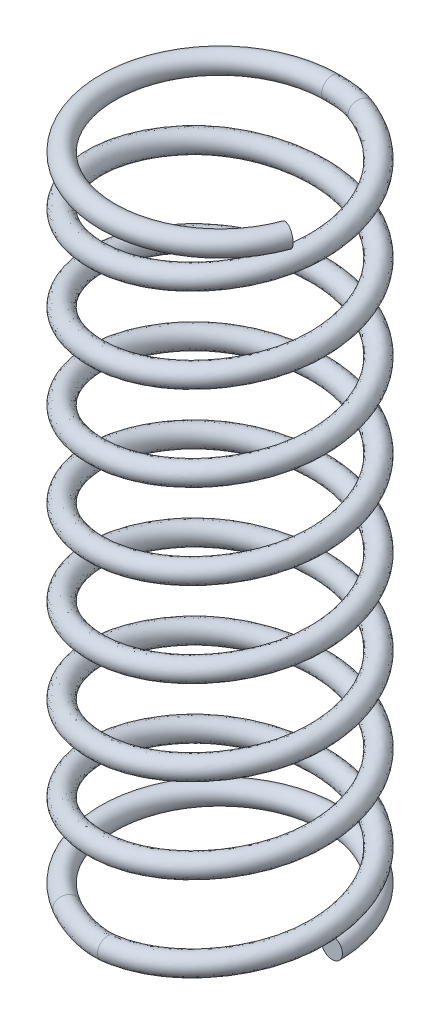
ISO-10303-21;
HEADER;
FILE_DESCRIPTION(('STEP AP214'),'2;1');
FILE_NAME('part.step','',(''),(''),'','','');
FILE_SCHEMA(('AUTOMOTIVE_DESIGN { 1 0 10303 214 1 1 1 1 }'));
ENDSEC;
DATA;
#1=APPLICATION_CONTEXT('core data for automotive mechanical design processes');
#2=APPLICATION_PROTOCOL_DEFINITION('international standard','automotive_design',2000,#1);
#3=PRODUCT_CONTEXT('',#1,'mechanical');
#4=PRODUCT('Part','Part','',(#3));
#5=PRODUCT_RELATED_PRODUCT_CATEGORY('part','',(#4));
#6=PRODUCT_DEFINITION_FORMATION('','',#4);
#7=PRODUCT_DEFINITION_CONTEXT('part definition',#1,'design');
#8=PRODUCT_DEFINITION('design','',#6,#7);
#9=PRODUCT_DEFINITION_SHAPE('','',#8);
#10=(LENGTH_UNIT() NAMED_UNIT(*) SI_UNIT(.MILLI.,.METRE.));
#11=(NAMED_UNIT(*) PLANE_ANGLE_UNIT() SI_UNIT($,.RADIAN.));
#12=(NAMED_UNIT(*) SI_UNIT($,.STERADIAN.) SOLID_ANGLE_UNIT());
#13=UNCERTAINTY_MEASURE_WITH_UNIT(LENGTH_MEASURE(1.E-05),#10,'distance_accuracy_value','');
#14=(GEOMETRIC_REPRESENTATION_CONTEXT(3) GLOBAL_UNCERTAINTY_ASSIGNED_CONTEXT((#13)) GLOBAL_UNIT_ASSIGNED_CONTEXT((#10,
#11,#12)) REPRESENTATION_CONTEXT('',''));
#15=CARTESIAN_POINT('',(0.,0.,0.));
#16=DIRECTION('',(0.,0.,1.));
#17=DIRECTION('',(1.,0.,0.));
#18=AXIS2_PLACEMENT_3D('',#15,#16,#17);
#19=CARTESIAN_POINT('',(0.,0.,0.));
#20=DIRECTION('',(0.,-1.,0.));
#21=DIRECTION('',(0.,0.,-1.));
#22=AXIS2_PLACEMENT_3D('',#19,#20,#21);
#23=TOROIDAL_SURFACE('',#22,6.858,0.634999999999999);
#24=CARTESIAN_POINT('',(-3.61552378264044,0.513868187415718,6.26227088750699));
#25=CARTESIAN_POINT('',(-3.61824018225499,0.509924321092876,6.26697582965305));
#26=CARTESIAN_POINT('',(-3.62092608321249,0.505896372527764,6.27162794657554));
#27=CARTESIAN_POINT('',(-3.62618290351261,0.497753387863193,6.2807330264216));
#28=CARTESIAN_POINT('',(-3.6287550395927,0.493641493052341,6.2851880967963));
#29=CARTESIAN_POINT('',(-3.63378672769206,0.485339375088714,6.29390323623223));
#30=CARTESIAN_POINT('',(-3.63624748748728,0.481152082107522,6.29816539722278));
#31=CARTESIAN_POINT('',(-3.64105874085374,0.472708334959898,6.30649873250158));
#32=CARTESIAN_POINT('',(-3.64341043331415,0.468454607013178,6.31057198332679));
#33=CARTESIAN_POINT('',(-3.65024089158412,0.455719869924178,6.32240268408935));
#34=CARTESIAN_POINT('',(-3.65462929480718,0.447043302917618,6.33000362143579));
#35=CARTESIAN_POINT('',(-3.66298868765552,0.42951084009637,6.34448251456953));
#36=CARTESIAN_POINT('',(-3.66696902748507,0.420672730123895,6.35137666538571));
#37=CARTESIAN_POINT('',(-3.67453208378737,0.402888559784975,6.3644762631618));
#38=CARTESIAN_POINT('',(-3.67812400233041,0.393958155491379,6.370697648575));
#39=CARTESIAN_POINT('',(-3.68492944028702,0.376061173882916,6.38248501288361));
#40=CARTESIAN_POINT('',(-3.68815209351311,0.367108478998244,6.38806681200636));
#41=CARTESIAN_POINT('',(-3.69423824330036,0.349238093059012,6.39860833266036));
#42=CARTESIAN_POINT('',(-3.69711087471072,0.340332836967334,6.40358387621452));
#43=CARTESIAN_POINT('',(-3.70251626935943,0.322628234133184,6.41294629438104));
#44=CARTESIAN_POINT('',(-3.70505823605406,0.31384012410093,6.41734910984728));
#45=CARTESIAN_POINT('',(-3.70749517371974,0.304937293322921,6.42157000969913));
#46=B_SPLINE_CURVE_WITH_KNOTS('',3,(#24,#25,#26,#27,#28,#29,#30,#31,#32,#33,#34,#35,#36,#37,#38,
#39,#40,#41,#42,#43,#44,#45),.UNSPECIFIED.,.F.,.F.,(4,2,2,2,2,2,2,2,2,2,4),(0.,
0.0201393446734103,0.0398933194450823,0.0592755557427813,0.0782980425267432,0.115299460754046,
0.150964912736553,0.185331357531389,0.218410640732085,0.250190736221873,0.280637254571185),.UNSPECIFIED.);
#47=CARTESIAN_POINT('',(-3.70751613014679,0.304960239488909,6.42160630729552));
#48=VERTEX_POINT('',#47);
#49=CARTESIAN_POINT('',(-3.61554149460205,0.513916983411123,6.2623015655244));
#50=VERTEX_POINT('',#49);
#51=EDGE_CURVE('E12',#48,#50,#46,.F.);
#52=ORIENTED_EDGE('',*,*,#51,.T.);
#53=CARTESIAN_POINT('',(-3.44437920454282,0.634254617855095,5.96583978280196));
#54=CARTESIAN_POINT('',(-3.44856424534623,0.633848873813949,5.97308848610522));
#55=CARTESIAN_POINT('',(-3.45274507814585,0.633272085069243,5.98032990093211));
#56=CARTESIAN_POINT('',(-3.46104416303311,0.631788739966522,5.99470433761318));
#57=CARTESIAN_POINT('',(-3.46516258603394,0.630886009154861,6.00183765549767));
#58=CARTESIAN_POINT('',(-3.47333256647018,0.628765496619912,6.01598847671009));
#59=CARTESIAN_POINT('',(-3.47738435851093,0.627551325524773,6.02300638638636));
#60=CARTESIAN_POINT('',(-3.48541684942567,0.6248228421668,6.03691906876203));
#61=CARTESIAN_POINT('',(-3.48939784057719,0.623311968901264,6.04381434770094));
#62=CARTESIAN_POINT('',(-3.49728449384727,0.620004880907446,6.05747443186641));
#63=CARTESIAN_POINT('',(-3.50119050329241,0.618211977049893,6.06423983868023));
#64=CARTESIAN_POINT('',(-3.50892296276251,0.614355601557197,6.07763285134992));
#65=CARTESIAN_POINT('',(-3.51274981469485,0.612295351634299,6.08426115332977));
#66=CARTESIAN_POINT('',(-3.52031972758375,0.607919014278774,6.09737262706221));
#67=CARTESIAN_POINT('',(-3.52406324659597,0.605606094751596,6.10385659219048));
#68=CARTESIAN_POINT('',(-3.53146226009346,0.600739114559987,6.11667205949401));
#69=CARTESIAN_POINT('',(-3.53511827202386,0.598188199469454,6.12300445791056));
#70=CARTESIAN_POINT('',(-3.54233803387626,0.592859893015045,6.13550945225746));
#71=CARTESIAN_POINT('',(-3.54590236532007,0.59008565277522,6.14168305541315));
#72=CARTESIAN_POINT('',(-3.55293452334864,0.584325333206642,6.15386311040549));
#73=CARTESIAN_POINT('',(-3.55640300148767,0.581342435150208,6.15987069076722));
#74=CARTESIAN_POINT('',(-3.5632392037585,0.575179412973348,6.17171134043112));
#75=CARTESIAN_POINT('',(-3.56660765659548,0.572002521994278,6.17754567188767));
#76=CARTESIAN_POINT('',(-3.57323955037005,0.565466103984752,6.18903244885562));
#77=CARTESIAN_POINT('',(-3.57650380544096,0.562109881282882,6.19468630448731));
#78=CARTESIAN_POINT('',(-3.58292304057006,0.555229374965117,6.20580474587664));
#79=CARTESIAN_POINT('',(-3.58607892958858,0.551708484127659,6.21127090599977));
#80=CARTESIAN_POINT('',(-3.59227714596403,0.544513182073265,6.22200653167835));
#81=CARTESIAN_POINT('',(-3.59532048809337,0.540842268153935,6.22727775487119));
#82=CARTESIAN_POINT('',(-3.60128936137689,0.533361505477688,6.23761614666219));
#83=CARTESIAN_POINT('',(-3.60421602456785,0.529555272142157,6.24268527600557));
#84=CARTESIAN_POINT('',(-3.60994710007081,0.521818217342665,6.25261178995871));
#85=CARTESIAN_POINT('',(-3.61275277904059,0.517891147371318,6.25747136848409));
#86=CARTESIAN_POINT('',(-3.61552378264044,0.513868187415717,6.26227088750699));
#87=B_SPLINE_CURVE_WITH_KNOTS('',3,(#53,#54,#55,#56,#57,#58,#59,#60,#61,#62,#63,#64,#65,#66,#67,
#68,#69,#70,#71,#72,#73,#74,#75,#76,#77,#78,#79,#80,#81,#82,#83,#84,#85,#86),.UNSPECIFIED.,.F.,
.F.,(4,2,2,2,2,2,2,2,2,2,2,2,2,2,2,2,4),(0.,0.0251377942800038,0.0499896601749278,
0.0745654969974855,0.0988717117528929,0.122911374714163,0.146684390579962,0.170187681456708,
0.193415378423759,0.216359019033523,0.23900774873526,0.261348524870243,0.283366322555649,
0.3050443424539,0.326364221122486,0.34730624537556,0.367849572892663),.UNSPECIFIED.);
#88=CARTESIAN_POINT('',(-3.44437925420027,0.63425666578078,5.96583986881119));
#89=VERTEX_POINT('',#88);
#90=EDGE_CURVE('E62',#50,#89,#87,.F.);
#91=ORIENTED_EDGE('',*,*,#90,.T.);
#92=CARTESIAN_POINT('',(-3.26821330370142,0.547554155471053,5.66071149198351));
#93=CARTESIAN_POINT('',(-3.27116594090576,0.551021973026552,5.66582560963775));
#94=CARTESIAN_POINT('',(-3.27414845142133,0.554387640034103,5.67099146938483));
#95=CARTESIAN_POINT('',(-3.28022696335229,0.560979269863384,5.68151976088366));
#96=CARTESIAN_POINT('',(-3.28332404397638,0.564201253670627,5.68688406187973));
#97=CARTESIAN_POINT('',(-3.28962683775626,0.570491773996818,5.6978008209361));
#98=CARTESIAN_POINT('',(-3.2928335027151,0.573556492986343,5.70335492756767));
#99=CARTESIAN_POINT('',(-3.29935075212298,0.579518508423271,5.7146431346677));
#100=CARTESIAN_POINT('',(-3.30266217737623,0.582412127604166,5.72037869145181));
#101=CARTESIAN_POINT('',(-3.30938417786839,0.588018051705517,5.73202153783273));
#102=CARTESIAN_POINT('',(-3.31279549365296,0.590726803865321,5.73793011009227));
#103=CARTESIAN_POINT('',(-3.31971250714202,0.595949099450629,5.74991072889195));
#104=CARTESIAN_POINT('',(-3.32321885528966,0.598459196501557,5.7559839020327));
#105=CARTESIAN_POINT('',(-3.33032115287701,0.603270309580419,5.76828544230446));
#106=CARTESIAN_POINT('',(-3.33391767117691,0.60556796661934,5.77451479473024));
#107=CARTESIAN_POINT('',(-3.34119552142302,0.609940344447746,5.78712040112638));
#108=CARTESIAN_POINT('',(-3.34487734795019,0.61201177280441,5.7934975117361));
#109=CARTESIAN_POINT('',(-3.35232102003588,0.615917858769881,5.80639032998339));
#110=CARTESIAN_POINT('',(-3.3560832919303,0.617749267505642,5.81290677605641));
#111=CARTESIAN_POINT('',(-3.36368305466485,0.621161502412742,5.82606995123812));
#112=CARTESIAN_POINT('',(-3.36752090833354,0.622739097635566,5.8327173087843));
#113=CARTESIAN_POINT('',(-3.37526703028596,0.625629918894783,5.84613398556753));
#114=CARTESIAN_POINT('',(-3.37917560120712,0.626939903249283,5.85290382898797));
#115=CARTESIAN_POINT('',(-3.38705835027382,0.629281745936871,5.86655715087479));
#116=CARTESIAN_POINT('',(-3.3910327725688,0.630310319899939,5.87344105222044));
#117=CARTESIAN_POINT('',(-3.39904241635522,0.632075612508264,5.88731416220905));
#118=CARTESIAN_POINT('',(-3.4030778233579,0.632808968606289,5.89430369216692));
#119=CARTESIAN_POINT('',(-3.41120462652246,0.63397014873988,5.90837972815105));
#120=CARTESIAN_POINT('',(-3.41529614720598,0.634394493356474,5.91546644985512));
#121=CARTESIAN_POINT('',(-3.42353038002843,0.63492394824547,5.92972855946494));
#122=CARTESIAN_POINT('',(-3.42767315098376,0.635025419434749,5.9369040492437));
#123=CARTESIAN_POINT('',(-3.43600505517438,0.634895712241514,5.95133533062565));
#124=CARTESIAN_POINT('',(-3.44019417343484,0.634660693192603,5.95859109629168));
#125=CARTESIAN_POINT('',(-3.44437920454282,0.634254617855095,5.96583978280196));
#126=B_SPLINE_CURVE_WITH_KNOTS('',3,(#92,#93,#94,#95,#96,#97,#98,#99,#100,#101,#102,#103,#104,
#105,#106,#107,#108,#109,#110,#111,#112,#113,#114,#115,#116,#117,#118,#119,#120,#121,#122,#123,
#124,#125),.UNSPECIFIED.,.F.,.F.,(4,2,2,2,2,2,2,2,2,2,2,2,2,2,2,2,4),(0.,0.0205433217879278,
0.0414853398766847,0.0628052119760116,0.0844832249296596,0.106501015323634,0.128841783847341,
0.151490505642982,0.174434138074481,0.197661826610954,0.221165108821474,0.244938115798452,
0.268977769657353,0.293283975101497,0.317859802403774,0.34271165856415,0.36784944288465),.UNSPECIFIED.);
#127=CARTESIAN_POINT('',(-3.26819885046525,0.547603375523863,5.66068645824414));
#128=VERTEX_POINT('',#127);
#129=EDGE_CURVE('E113',#89,#128,#126,.F.);
#130=ORIENTED_EDGE('',*,*,#129,.T.);
#131=CARTESIAN_POINT('',(-3.1665650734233,0.3574026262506,5.48465159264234));
#132=CARTESIAN_POINT('',(-3.16942130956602,0.365792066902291,5.48959873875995));
#133=CARTESIAN_POINT('',(-3.17237653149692,0.374046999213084,5.4947173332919));
#134=CARTESIAN_POINT('',(-3.17861313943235,0.390622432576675,5.50551945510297));
#135=CARTESIAN_POINT('',(-3.18190314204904,0.398929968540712,5.5112179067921));
#136=CARTESIAN_POINT('',(-3.18882533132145,0.415538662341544,5.52320749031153));
#137=CARTESIAN_POINT('',(-3.19246600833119,0.423825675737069,5.52951332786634));
#138=CARTESIAN_POINT('',(-3.20010539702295,0.4403216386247,5.54274513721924));
#139=CARTESIAN_POINT('',(-3.20411252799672,0.448515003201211,5.5496856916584));
#140=CARTESIAN_POINT('',(-3.21250052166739,0.464752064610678,5.56421412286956));
#141=CARTESIAN_POINT('',(-3.21688978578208,0.472778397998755,5.57181655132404));
#142=CARTESIAN_POINT('',(-3.22605820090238,0.488610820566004,5.58769671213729));
#143=CARTESIAN_POINT('',(-3.23084579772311,0.496397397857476,5.59598907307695));
#144=CARTESIAN_POINT('',(-3.23826033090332,0.507750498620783,5.60883142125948));
#145=CARTESIAN_POINT('',(-3.24080679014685,0.511529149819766,5.61324201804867));
#146=CARTESIAN_POINT('',(-3.24600398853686,0.519002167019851,5.62224382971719));
#147=CARTESIAN_POINT('',(-3.24865578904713,0.522693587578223,5.62683688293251));
#148=CARTESIAN_POINT('',(-3.25406553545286,0.529982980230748,5.6362068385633));
#149=CARTESIAN_POINT('',(-3.25682454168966,0.533577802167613,5.64098557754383));
#150=CARTESIAN_POINT('',(-3.26245066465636,0.540665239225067,5.65073030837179));
#151=CARTESIAN_POINT('',(-3.26531884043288,0.544154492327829,5.65569813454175));
#152=CARTESIAN_POINT('',(-3.26821330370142,0.547554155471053,5.66071149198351));
#153=B_SPLINE_CURVE_WITH_KNOTS('',3,(#131,#132,#133,#134,#135,#136,#137,#138,#139,#140,#141,
#142,#143,#144,#145,#146,#147,#148,#149,#150,#151,#152),.UNSPECIFIED.,.F.,.F.,(4,2,2,2,2,2,2,2,
2,2,4),(0.,0.0304465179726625,0.0622266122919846,0.095305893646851,0.12967233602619,
0.165337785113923,0.202339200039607,0.221361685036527,0.240743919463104,0.260497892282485,
0.280637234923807),.UNSPECIFIED.);
#154=CARTESIAN_POINT('',(-3.16654002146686,0.357436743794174,5.48460820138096));
#155=VERTEX_POINT('',#154);
#156=EDGE_CURVE('E335',#128,#155,#153,.F.);
#157=ORIENTED_EDGE('',*,*,#156,.T.);
#158=CARTESIAN_POINT('',(-3.12375648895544,0.174730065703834,5.4105049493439));
#159=CARTESIAN_POINT('',(-3.1247571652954,0.181725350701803,5.41223817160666));
#160=CARTESIAN_POINT('',(-3.12581467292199,0.188688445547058,5.41406982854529));
#161=CARTESIAN_POINT('',(-3.12809355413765,0.202836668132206,5.41801696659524));
#162=CARTESIAN_POINT('',(-3.12932000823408,0.210018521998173,5.42014124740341));
#163=CARTESIAN_POINT('',(-3.13195600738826,0.224588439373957,5.42470693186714));
#164=CARTESIAN_POINT('',(-3.13337107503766,0.231972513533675,5.42715790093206));
#165=CARTESIAN_POINT('',(-3.1364029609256,0.246931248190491,5.43240928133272));
#166=CARTESIAN_POINT('',(-3.13802571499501,0.254501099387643,5.43521997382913));
#167=CARTESIAN_POINT('',(-3.14149180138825,0.269815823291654,5.44122341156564));
#168=CARTESIAN_POINT('',(-3.14334148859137,0.27755494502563,5.44442716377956));
#169=CARTESIAN_POINT('',(-3.14728020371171,0.29319281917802,5.45124921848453));
#170=CARTESIAN_POINT('',(-3.14937599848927,0.301084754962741,5.45487924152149));
#171=CARTESIAN_POINT('',(-3.15382578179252,0.317012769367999,5.4625864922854));
#172=CARTESIAN_POINT('',(-3.15618694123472,0.325040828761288,5.46667614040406));
#173=CARTESIAN_POINT('',(-3.16118602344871,0.341226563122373,5.47533480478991));
#174=CARTESIAN_POINT('',(-3.16383148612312,0.349374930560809,5.47991688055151));
#175=CARTESIAN_POINT('',(-3.1665650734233,0.3574026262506,5.48465159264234));
#176=B_SPLINE_CURVE_WITH_KNOTS('',3,(#158,#159,#160,#161,#162,#163,#164,#165,#166,#167,#168,
#169,#170,#171,#172,#173,#174,#175),.UNSPECIFIED.,.F.,.F.,(4,2,2,2,2,2,2,2,4),(0.,
0.0218273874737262,0.0445902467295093,0.068308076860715,0.0930102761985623,0.118736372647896,
0.145536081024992,0.173469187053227,0.202605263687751),.UNSPECIFIED.);
#177=CARTESIAN_POINT('',(-3.12373249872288,0.174743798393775,5.41046339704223));
#178=VERTEX_POINT('',#177);
#179=EDGE_CURVE('E325',#155,#178,#176,.F.);
#180=ORIENTED_EDGE('',*,*,#179,.T.);
#181=CARTESIAN_POINT('',(-3.1118726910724,0.0307584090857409,5.38992160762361));
#182=CARTESIAN_POINT('',(-3.11200063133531,0.0360446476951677,5.3901432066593));
#183=CARTESIAN_POINT('',(-3.11215955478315,0.0413280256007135,5.39041847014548));
#184=CARTESIAN_POINT('',(-3.11254913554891,0.0520934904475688,5.39109324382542));
#185=CARTESIAN_POINT('',(-3.11278237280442,0.0575752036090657,5.39149722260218));
#186=CARTESIAN_POINT('',(-3.11333135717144,0.0687407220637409,5.39244809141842));
#187=CARTESIAN_POINT('',(-3.11364999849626,0.0744239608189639,5.3929999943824));
#188=CARTESIAN_POINT('',(-3.11438021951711,0.0859958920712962,5.39426477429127));
#189=CARTESIAN_POINT('',(-3.1147949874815,0.09188378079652,5.39498317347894));
#190=CARTESIAN_POINT('',(-3.11572799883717,0.103868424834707,5.39659919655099));
#191=CARTESIAN_POINT('',(-3.11624972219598,0.109964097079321,5.39750284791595));
#192=CARTESIAN_POINT('',(-3.11740714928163,0.122367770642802,5.39950757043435));
#193=CARTESIAN_POINT('',(-3.11804661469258,0.128674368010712,5.40061515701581));
#194=CARTESIAN_POINT('',(-3.11945008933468,0.141503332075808,5.40304604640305));
#195=CARTESIAN_POINT('',(-3.12021813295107,0.14802393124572,5.40437633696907));
#196=CARTESIAN_POINT('',(-3.12188917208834,0.161284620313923,5.40727066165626));
#197=CARTESIAN_POINT('',(-3.12279645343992,0.168022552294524,5.40884211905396));
#198=CARTESIAN_POINT('',(-3.12375648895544,0.174730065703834,5.4105049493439));
#199=B_SPLINE_CURVE_WITH_KNOTS('',3,(#181,#182,#183,#184,#185,#186,#187,#188,#189,#190,#191,
#192,#193,#194,#195,#196,#197,#198),.UNSPECIFIED.,.F.,.F.,(4,2,2,2,2,2,2,2,4),(0.,
0.0158771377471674,0.0323799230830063,0.0495343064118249,0.0673699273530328,0.0859201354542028,
0.105221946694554,0.125315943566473,0.146246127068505),.UNSPECIFIED.);
#200=CARTESIAN_POINT('',(-3.11187166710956,0.0307585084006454,5.38991983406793));
#201=VERTEX_POINT('',#200);
#202=EDGE_CURVE('E314',#178,#201,#199,.F.);
#203=ORIENTED_EDGE('',*,*,#202,.T.);
#204=CARTESIAN_POINT('',(-3.11673513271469,-0.114837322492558,5.39834360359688));
#205=CARTESIAN_POINT('',(-3.11610412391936,-0.107975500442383,5.39725066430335));
#206=CARTESIAN_POINT('',(-3.11552709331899,-0.101093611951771,5.39625121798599));
#207=CARTESIAN_POINT('',(-3.11450547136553,-0.0875717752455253,5.39448171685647));
#208=CARTESIAN_POINT('',(-3.11405650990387,-0.0809331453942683,5.39370409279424));
#209=CARTESIAN_POINT('',(-3.11328030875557,-0.0678927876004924,5.39235967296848));
#210=CARTESIAN_POINT('',(-3.11294896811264,-0.0614920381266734,5.39178577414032));
#211=CARTESIAN_POINT('',(-3.11239708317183,-0.0489225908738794,5.39082988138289));
#212=CARTESIAN_POINT('',(-3.11217272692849,-0.0427545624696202,5.39044128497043));
#213=CARTESIAN_POINT('',(-3.11182393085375,-0.0306456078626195,5.38983715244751));
#214=CARTESIAN_POINT('',(-3.11169597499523,-0.0247050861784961,5.38961552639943));
#215=CARTESIAN_POINT('',(-3.1115290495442,-0.0130461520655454,5.38932640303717));
#216=CARTESIAN_POINT('',(-3.11148686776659,-0.00732792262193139,5.38925334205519));
#217=CARTESIAN_POINT('',(-3.11148066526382,0.00389143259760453,5.38924259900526));
#218=CARTESIAN_POINT('',(-3.11151373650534,0.00939255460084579,5.38929988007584));
#219=CARTESIAN_POINT('',(-3.11164683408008,0.0201828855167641,5.38953041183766));
#220=CARTESIAN_POINT('',(-3.11174427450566,0.0254722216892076,5.38969918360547));
#221=CARTESIAN_POINT('',(-3.1118726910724,0.0307584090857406,5.38992160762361));
#222=B_SPLINE_CURVE_WITH_KNOTS('',3,(#204,#205,#206,#207,#208,#209,#210,#211,#212,#213,#214,
#215,#216,#217,#218,#219,#220,#221),.UNSPECIFIED.,.F.,.F.,(4,2,2,2,2,2,2,2,4),(0.,
0.0209301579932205,0.041024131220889,0.0603259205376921,0.0788761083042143,0.0967117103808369,
0.113866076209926,0.130368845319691,0.146245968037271),.UNSPECIFIED.);
#223=CARTESIAN_POINT('',(-3.11670513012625,-0.114848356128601,5.39829163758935));
#224=VERTEX_POINT('',#223);
#225=EDGE_CURVE('E303',#201,#224,#222,.F.);
#226=ORIENTED_EDGE('',*,*,#225,.T.);
#227=CARTESIAN_POINT('',(-3.15050484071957,-0.304937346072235,5.4568344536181));
#228=CARTESIAN_POINT('',(-3.14817247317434,-0.296418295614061,5.45279467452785));
#229=CARTESIAN_POINT('',(-3.14593365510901,-0.287796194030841,5.44891692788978));
#230=CARTESIAN_POINT('',(-3.14174112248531,-0.270718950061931,5.44165524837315));
#231=CARTESIAN_POINT('',(-3.13977945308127,-0.262271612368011,5.4382575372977));
#232=CARTESIAN_POINT('',(-3.13612117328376,-0.245557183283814,5.43192121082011));
#233=CARTESIAN_POINT('',(-3.13441703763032,-0.237296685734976,5.42896956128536));
#234=CARTESIAN_POINT('',(-3.13125339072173,-0.220969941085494,5.42348996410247));
#235=CARTESIAN_POINT('',(-3.12978681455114,-0.212909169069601,5.42094977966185));
#236=CARTESIAN_POINT('',(-3.12707794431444,-0.196995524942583,5.41625787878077));
#237=CARTESIAN_POINT('',(-3.12582904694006,-0.189147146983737,5.41409472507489));
#238=CARTESIAN_POINT('',(-3.12353511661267,-0.173671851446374,5.41012152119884));
#239=CARTESIAN_POINT('',(-3.12248394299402,-0.166048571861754,5.40830083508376));
#240=CARTESIAN_POINT('',(-3.12056523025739,-0.151036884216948,5.40497752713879));
#241=CARTESIAN_POINT('',(-3.11969200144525,-0.143651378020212,5.40346505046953));
#242=CARTESIAN_POINT('',(-3.11810832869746,-0.129128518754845,5.40072204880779));
#243=CARTESIAN_POINT('',(-3.11739266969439,-0.121993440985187,5.39948249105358));
#244=CARTESIAN_POINT('',(-3.11673513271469,-0.114837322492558,5.39834360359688));
#245=B_SPLINE_CURVE_WITH_KNOTS('',3,(#227,#228,#229,#230,#231,#232,#233,#234,#235,#236,#237,
#238,#239,#240,#241,#242,#243,#244),.UNSPECIFIED.,.F.,.F.,(4,2,2,2,2,2,2,2,4),(0.,
0.0291360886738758,0.0570692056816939,0.0838689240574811,0.109595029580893,0.134297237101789,
0.158015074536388,0.180777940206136,0.202605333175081),.UNSPECIFIED.);
#246=CARTESIAN_POINT('',(-3.15048388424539,-0.304960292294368,5.45679815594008));
#247=VERTEX_POINT('',#246);
#248=EDGE_CURVE('E292',#224,#247,#245,.F.);
#249=ORIENTED_EDGE('',*,*,#248,.T.);
#250=CARTESIAN_POINT('',(-3.24247621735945,-0.513868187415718,5.61613355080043));
#251=CARTESIAN_POINT('',(-3.23975981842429,-0.509924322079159,5.6114286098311));
#252=CARTESIAN_POINT('',(-3.23707391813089,-0.505896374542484,5.60677649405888));
#253=CARTESIAN_POINT('',(-3.2318170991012,-0.497753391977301,5.59767141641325));
#254=CARTESIAN_POINT('',(-3.22924496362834,-0.493641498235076,5.59321634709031));
#255=CARTESIAN_POINT('',(-3.22421327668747,-0.485339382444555,5.58450120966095));
#256=CARTESIAN_POINT('',(-3.22175251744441,-0.481152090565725,5.58023904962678));
#257=CARTESIAN_POINT('',(-3.21694126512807,-0.472708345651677,5.57190571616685));
#258=CARTESIAN_POINT('',(-3.21458957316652,-0.468454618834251,5.56783246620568));
#259=CARTESIAN_POINT('',(-3.20775911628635,-0.455719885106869,5.55600176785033));
#260=CARTESIAN_POINT('',(-3.20337071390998,-0.447043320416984,5.54840083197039));
#261=CARTESIAN_POINT('',(-3.19501132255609,-0.429510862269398,5.5339219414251));
#262=CARTESIAN_POINT('',(-3.19103098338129,-0.420672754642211,5.52702779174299));
#263=CARTESIAN_POINT('',(-3.18346792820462,-0.402888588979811,5.51392819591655));
#264=CARTESIAN_POINT('',(-3.17987601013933,-0.393958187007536,5.50770681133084));
#265=CARTESIAN_POINT('',(-3.17307057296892,-0.376061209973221,5.49591944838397));
#266=CARTESIAN_POINT('',(-3.16984792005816,-0.367108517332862,5.49033764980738));
#267=CARTESIAN_POINT('',(-3.16376177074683,-0.349238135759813,5.4797961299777));
#268=CARTESIAN_POINT('',(-3.16088913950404,-0.340332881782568,5.47482058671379));
#269=CARTESIAN_POINT('',(-3.15548374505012,-0.32262828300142,5.46545816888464));
#270=CARTESIAN_POINT('',(-3.15294177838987,-0.313840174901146,5.46105535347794));
#271=CARTESIAN_POINT('',(-3.15050484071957,-0.304937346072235,5.4568344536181));
#272=B_SPLINE_CURVE_WITH_KNOTS('',3,(#250,#251,#252,#253,#254,#255,#256,#257,#258,#259,#260,
#261,#262,#263,#264,#265,#266,#267,#268,#269,#270,#271),.UNSPECIFIED.,.F.,.F.,(4,2,2,2,2,2,2,2,
2,2,4),(0.,0.0201393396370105,0.0398933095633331,0.059275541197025,0.0782980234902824,
0.115299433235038,0.150964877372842,0.185331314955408,0.218410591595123,0.250190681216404,
0.280637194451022),.UNSPECIFIED.);
#273=CARTESIAN_POINT('',(-3.24245850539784,-0.513916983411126,5.61610287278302));
#274=VERTEX_POINT('',#273);
#275=EDGE_CURVE('E281',#247,#274,#272,.F.);
#276=ORIENTED_EDGE('',*,*,#275,.T.);
#277=CARTESIAN_POINT('',(-3.41362079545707,-0.634254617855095,5.91256465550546));
#278=CARTESIAN_POINT('',(-3.40943575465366,-0.63384887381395,5.9053159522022));
#279=CARTESIAN_POINT('',(-3.40525492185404,-0.633272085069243,5.89807453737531));
#280=CARTESIAN_POINT('',(-3.39695583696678,-0.631788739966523,5.88370010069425));
#281=CARTESIAN_POINT('',(-3.39283741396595,-0.630886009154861,5.87656678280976));
#282=CARTESIAN_POINT('',(-3.38466743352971,-0.628765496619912,5.86241596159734));
#283=CARTESIAN_POINT('',(-3.38061564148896,-0.627551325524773,5.85539805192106));
#284=CARTESIAN_POINT('',(-3.37258315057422,-0.6248228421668,5.84148536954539));
#285=CARTESIAN_POINT('',(-3.3686021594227,-0.623311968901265,5.83459009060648));
#286=CARTESIAN_POINT('',(-3.36071550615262,-0.620004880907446,5.82093000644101));
#287=CARTESIAN_POINT('',(-3.35680949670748,-0.618211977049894,5.81416459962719));
#288=CARTESIAN_POINT('',(-3.34907703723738,-0.614355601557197,5.8007715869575));
#289=CARTESIAN_POINT('',(-3.34525018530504,-0.612295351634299,5.79414328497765));
#290=CARTESIAN_POINT('',(-3.33768027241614,-0.607919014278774,5.78103181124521));
#291=CARTESIAN_POINT('',(-3.33393675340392,-0.605606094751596,5.77454784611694));
#292=CARTESIAN_POINT('',(-3.32653773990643,-0.600739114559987,5.76173237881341));
#293=CARTESIAN_POINT('',(-3.32288172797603,-0.598188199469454,5.75539998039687));
#294=CARTESIAN_POINT('',(-3.31566196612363,-0.592859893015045,5.74289498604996));
#295=CARTESIAN_POINT('',(-3.31209763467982,-0.59008565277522,5.73672138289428));
#296=CARTESIAN_POINT('',(-3.30506547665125,-0.584325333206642,5.72454132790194));
#297=CARTESIAN_POINT('',(-3.30159699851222,-0.581342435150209,5.7185337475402));
#298=CARTESIAN_POINT('',(-3.29476079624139,-0.575179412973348,5.7066930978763));
#299=CARTESIAN_POINT('',(-3.29139234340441,-0.572002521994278,5.70085876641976));
#300=CARTESIAN_POINT('',(-3.28476044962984,-0.565466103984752,5.6893719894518));
#301=CARTESIAN_POINT('',(-3.28149619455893,-0.562109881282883,5.68371813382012));
#302=CARTESIAN_POINT('',(-3.27507695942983,-0.555229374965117,5.67259969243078));
#303=CARTESIAN_POINT('',(-3.27192107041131,-0.551708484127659,5.66713353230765));
#304=CARTESIAN_POINT('',(-3.26572285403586,-0.544513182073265,5.65639790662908));
#305=CARTESIAN_POINT('',(-3.26267951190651,-0.540842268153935,5.65112668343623));
#306=CARTESIAN_POINT('',(-3.25671063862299,-0.533361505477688,5.64078829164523));
#307=CARTESIAN_POINT('',(-3.25378397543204,-0.529555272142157,5.63571916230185));
#308=CARTESIAN_POINT('',(-3.24805289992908,-0.521818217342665,5.62579264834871));
#309=CARTESIAN_POINT('',(-3.2452472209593,-0.517891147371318,5.62093306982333));
#310=CARTESIAN_POINT('',(-3.24247621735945,-0.513868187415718,5.61613355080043));
#311=B_SPLINE_CURVE_WITH_KNOTS('',3,(#277,#278,#279,#280,#281,#282,#283,#284,#285,#286,#287,
#288,#289,#290,#291,#292,#293,#294,#295,#296,#297,#298,#299,#300,#301,#302,#303,#304,#305,#306,
#307,#308,#309,#310),.UNSPECIFIED.,.F.,.F.,(4,2,2,2,2,2,2,2,2,2,2,2,2,2,2,2,4),(0.,
0.0251377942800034,0.0499896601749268,0.0745654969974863,0.0988717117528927,0.122911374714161,
0.146684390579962,0.170187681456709,0.193415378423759,0.216359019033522,0.239007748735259,
0.261348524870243,0.283366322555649,0.3050443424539,0.326364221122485,0.34730624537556,
0.367849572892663),.UNSPECIFIED.);
#312=CARTESIAN_POINT('',(-3.41362074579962,-0.63425666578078,5.91256456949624));
#313=VERTEX_POINT('',#312);
#314=EDGE_CURVE('E270',#274,#313,#311,.F.);
#315=ORIENTED_EDGE('',*,*,#314,.T.);
#316=CARTESIAN_POINT('',(-3.58978669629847,-0.547554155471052,6.21769294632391));
#317=CARTESIAN_POINT('',(-3.58683405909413,-0.551021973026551,6.21257882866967));
#318=CARTESIAN_POINT('',(-3.58385154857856,-0.554387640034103,6.2074129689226));
#319=CARTESIAN_POINT('',(-3.5777730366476,-0.560979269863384,6.19688467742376));
#320=CARTESIAN_POINT('',(-3.5746759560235,-0.564201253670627,6.19152037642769));
#321=CARTESIAN_POINT('',(-3.56837316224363,-0.570491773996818,6.18060361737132));
#322=CARTESIAN_POINT('',(-3.56516649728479,-0.573556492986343,6.17504951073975));
#323=CARTESIAN_POINT('',(-3.55864924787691,-0.579518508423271,6.16376130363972));
#324=CARTESIAN_POINT('',(-3.55533782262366,-0.582412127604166,6.15802574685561));
#325=CARTESIAN_POINT('',(-3.5486158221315,-0.588018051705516,6.14638290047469));
#326=CARTESIAN_POINT('',(-3.54520450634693,-0.590726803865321,6.14047432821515));
#327=CARTESIAN_POINT('',(-3.53828749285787,-0.595949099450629,6.12849370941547));
#328=CARTESIAN_POINT('',(-3.53478114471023,-0.598459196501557,6.12242053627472));
#329=CARTESIAN_POINT('',(-3.52767884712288,-0.603270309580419,6.11011899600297));
#330=CARTESIAN_POINT('',(-3.52408232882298,-0.60556796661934,6.10388964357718));
#331=CARTESIAN_POINT('',(-3.51680447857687,-0.609940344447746,6.09128403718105));
#332=CARTESIAN_POINT('',(-3.5131226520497,-0.61201177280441,6.08490692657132));
#333=CARTESIAN_POINT('',(-3.50567897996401,-0.615917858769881,6.07201410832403));
#334=CARTESIAN_POINT('',(-3.50191670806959,-0.617749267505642,6.06549766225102));
#335=CARTESIAN_POINT('',(-3.49431694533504,-0.621161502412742,6.05233448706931));
#336=CARTESIAN_POINT('',(-3.49047909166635,-0.622739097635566,6.04568712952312));
#337=CARTESIAN_POINT('',(-3.48273296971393,-0.625629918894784,6.0322704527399));
#338=CARTESIAN_POINT('',(-3.47882439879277,-0.626939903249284,6.02550060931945));
#339=CARTESIAN_POINT('',(-3.47094164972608,-0.629281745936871,6.01184728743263));
#340=CARTESIAN_POINT('',(-3.46696722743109,-0.630310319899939,6.00496338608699));
#341=CARTESIAN_POINT('',(-3.45895758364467,-0.632075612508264,5.99109027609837));
#342=CARTESIAN_POINT('',(-3.45492217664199,-0.632808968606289,5.9841007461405));
#343=CARTESIAN_POINT('',(-3.44679537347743,-0.63397014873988,5.97002471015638));
#344=CARTESIAN_POINT('',(-3.44270385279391,-0.634394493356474,5.9629379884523));
#345=CARTESIAN_POINT('',(-3.43446961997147,-0.63492394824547,5.94867587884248));
#346=CARTESIAN_POINT('',(-3.43032684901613,-0.63502541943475,5.94150038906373));
#347=CARTESIAN_POINT('',(-3.42199494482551,-0.634895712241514,5.92706910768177));
#348=CARTESIAN_POINT('',(-3.41780582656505,-0.634660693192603,5.91981334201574));
#349=CARTESIAN_POINT('',(-3.41362079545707,-0.634254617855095,5.91256465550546));
#350=B_SPLINE_CURVE_WITH_KNOTS('',3,(#316,#317,#318,#319,#320,#321,#322,#323,#324,#325,#326,
#327,#328,#329,#330,#331,#332,#333,#334,#335,#336,#337,#338,#339,#340,#341,#342,#343,#344,#345,
#346,#347,#348,#349),.UNSPECIFIED.,.F.,.F.,(4,2,2,2,2,2,2,2,2,2,2,2,2,2,2,2,4),(0.,
0.0205433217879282,0.0414853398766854,0.0628052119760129,0.0844832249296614,0.106501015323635,
0.128841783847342,0.151490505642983,0.17443413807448,0.197661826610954,0.221165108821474,
0.244938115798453,0.268977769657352,0.293283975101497,0.317859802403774,0.342711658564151,
0.36784944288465),.UNSPECIFIED.);
#351=CARTESIAN_POINT('',(-3.58980114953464,-0.547603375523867,6.21771798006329));
#352=VERTEX_POINT('',#351);
#353=EDGE_CURVE('E259',#313,#352,#350,.F.);
#354=ORIENTED_EDGE('',*,*,#353,.T.);
#355=CARTESIAN_POINT('',(-3.73424353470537,-0.174729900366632,6.46789952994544));
#356=CARTESIAN_POINT('',(-3.73324285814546,-0.181725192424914,6.46616630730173));
#357=CARTESIAN_POINT('',(-3.73218535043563,-0.188688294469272,6.4643346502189));
#358=CARTESIAN_POINT('',(-3.7299064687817,-0.202836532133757,6.46038751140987));
#359=CARTESIAN_POINT('',(-3.72868001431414,-0.210018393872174,6.45826322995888));
#360=CARTESIAN_POINT('',(-3.72604401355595,-0.224588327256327,6.45369754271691));
#361=CARTESIAN_POINT('',(-3.72462894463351,-0.231972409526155,6.45124657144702));
#362=CARTESIAN_POINT('',(-3.72159705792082,-0.246931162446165,6.44599518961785));
#363=CARTESIAN_POINT('',(-3.71997430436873,-0.254501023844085,6.44318449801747));
#364=CARTESIAN_POINT('',(-3.7165082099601,-0.269815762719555,6.43718104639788));
#365=CARTESIAN_POINT('',(-3.71465851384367,-0.277554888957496,6.43397727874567));
#366=CARTESIAN_POINT('',(-3.7107198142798,-0.293192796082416,6.42715525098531));
#367=CARTESIAN_POINT('',(-3.70862404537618,-0.301084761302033,6.42352527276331));
#368=CARTESIAN_POINT('',(-3.70417417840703,-0.317012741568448,6.41581787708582));
#369=CARTESIAN_POINT('',(-3.70181290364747,-0.325040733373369,6.41172802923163));
#370=CARTESIAN_POINT('',(-3.69681412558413,-0.341226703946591,6.40306989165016));
#371=CARTESIAN_POINT('',(-3.69416910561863,-0.349375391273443,6.39848858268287));
#372=CARTESIAN_POINT('',(-3.68857774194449,-0.36579099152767,6.38880405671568));
#373=CARTESIAN_POINT('',(-3.6856231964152,-0.374046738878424,6.38368663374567));
#374=CARTESIAN_POINT('',(-3.67938710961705,-0.390622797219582,6.37288541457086));
#375=CARTESIAN_POINT('',(-3.67609691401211,-0.398930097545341,6.36718662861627));
#376=CARTESIAN_POINT('',(-3.66917457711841,-0.415538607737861,6.35519678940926));
#377=CARTESIAN_POINT('',(-3.66553395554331,-0.423825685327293,6.34889104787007));
#378=CARTESIAN_POINT('',(-3.65789461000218,-0.440321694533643,6.33565931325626));
#379=CARTESIAN_POINT('',(-3.65388746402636,-0.448515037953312,6.32871873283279));
#380=CARTESIAN_POINT('',(-3.64549945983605,-0.464752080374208,6.31419028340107));
#381=CARTESIAN_POINT('',(-3.64111020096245,-0.47277841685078,6.30658786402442));
#382=CARTESIAN_POINT('',(-3.63194179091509,-0.488610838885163,6.29070771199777));
#383=CARTESIAN_POINT('',(-3.62715419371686,-0.496397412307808,6.28241535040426));
#384=CARTESIAN_POINT('',(-3.61973966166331,-0.507750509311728,6.26957300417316));
#385=CARTESIAN_POINT('',(-3.61719320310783,-0.511529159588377,6.2651624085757));
#386=CARTESIAN_POINT('',(-3.61199600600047,-0.519002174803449,6.25616059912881));
#387=CARTESIAN_POINT('',(-3.60934420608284,-0.522693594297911,6.25156754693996));
#388=CARTESIAN_POINT('',(-3.60393446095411,-0.529982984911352,6.24219759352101));
#389=CARTESIAN_POINT('',(-3.60117545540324,-0.533577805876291,6.23741885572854));
#390=CARTESIAN_POINT('',(-3.59554933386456,-0.540665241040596,6.22767412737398));
#391=CARTESIAN_POINT('',(-3.59268115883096,-0.544154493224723,6.22270630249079));
#392=CARTESIAN_POINT('',(-3.58978669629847,-0.547554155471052,6.21769294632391));
#393=B_SPLINE_CURVE_WITH_KNOTS('',3,(#355,#356,#357,#358,#359,#360,#361,#362,#363,#364,#365,
#366,#367,#368,#369,#370,#371,#372,#373,#374,#375,#376,#377,#378,#379,#380,#381,#382,#383,#384,
#385,#386,#387,#388,#389,#390,#391,#392),.UNSPECIFIED.,.F.,.F.,(4,2,2,2,2,2,2,2,2,2,2,2,2,2,2,2,
2,2,4),(0.,0.0218274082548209,0.0445902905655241,0.0683081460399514,0.0930103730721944,
0.118736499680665,0.14553624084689,0.173469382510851,0.202605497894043,0.233052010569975,
0.264832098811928,0.297911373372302,0.332277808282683,0.367943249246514,0.40494465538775,
0.423967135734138,0.443349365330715,0.463103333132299,0.483242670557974),.UNSPECIFIED.);
#394=CARTESIAN_POINT('',(-3.73424412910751,-0.174730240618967,6.46790055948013));
#395=VERTEX_POINT('',#394);
#396=EDGE_CURVE('E248',#352,#395,#393,.F.);
#397=ORIENTED_EDGE('',*,*,#396,.T.);
#398=CARTESIAN_POINT('',(-3.74612730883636,-0.0307584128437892,6.48848283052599));
#399=CARTESIAN_POINT('',(-3.74599936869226,-0.0360446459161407,6.48826123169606));
#400=CARTESIAN_POINT('',(-3.74584044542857,-0.04132801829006,6.48798596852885));
#401=CARTESIAN_POINT('',(-3.74545086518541,-0.0520934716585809,6.48731119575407));
#402=CARTESIAN_POINT('',(-3.7452176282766,-0.0575751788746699,6.48690721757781));
#403=CARTESIAN_POINT('',(-3.74466864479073,-0.0687406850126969,6.48595635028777));
#404=CARTESIAN_POINT('',(-3.74435000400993,-0.0744239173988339,6.48540444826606));
#405=CARTESIAN_POINT('',(-3.74361978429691,-0.0859958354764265,6.48413967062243));
#406=CARTESIAN_POINT('',(-3.74320501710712,-0.0918837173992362,6.48342127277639));
#407=CARTESIAN_POINT('',(-3.74227200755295,-0.103868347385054,6.48180525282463));
#408=CARTESIAN_POINT('',(-3.741750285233,-0.109964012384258,6.48090160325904));
#409=CARTESIAN_POINT('',(-3.7405928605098,-0.122367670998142,6.47889688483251));
#410=CARTESIAN_POINT('',(-3.73995339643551,-0.128674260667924,6.47778930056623));
#411=CARTESIAN_POINT('',(-3.73854992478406,-0.141503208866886,6.47535841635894));
#412=CARTESIAN_POINT('',(-3.73778188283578,-0.148023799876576,6.47402812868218));
#413=CARTESIAN_POINT('',(-3.73611084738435,-0.161284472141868,6.47113381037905));
#414=CARTESIAN_POINT('',(-3.73520356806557,-0.168022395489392,6.46956235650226));
#415=CARTESIAN_POINT('',(-3.73424353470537,-0.174729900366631,6.46789952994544));
#416=B_SPLINE_CURVE_WITH_KNOTS('',3,(#398,#399,#400,#401,#402,#403,#404,#405,#406,#407,#408,
#409,#410,#411,#412,#413,#414,#415),.UNSPECIFIED.,.F.,.F.,(4,2,2,2,2,2,2,2,4),(0.,
0.0158771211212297,0.0323798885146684,0.0495342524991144,0.0673698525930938,0.0859200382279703,
0.105221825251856,0.125315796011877,0.146245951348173),.UNSPECIFIED.);
#417=CARTESIAN_POINT('',(-3.74613337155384,-0.0307589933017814,6.4884933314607));
#418=VERTEX_POINT('',#417);
#419=EDGE_CURVE('E225',#395,#418,#416,.F.);
#420=ORIENTED_EDGE('',*,*,#419,.T.);
#421=CARTESIAN_POINT('',(-3.70749517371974,0.304937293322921,6.42157000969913));
#422=CARTESIAN_POINT('',(-3.70982754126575,0.296418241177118,6.42560978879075));
#423=CARTESIAN_POINT('',(-3.71206635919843,0.2877961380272,6.42948753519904));
#424=CARTESIAN_POINT('',(-3.71625889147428,0.27071889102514,6.43674921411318));
#425=CARTESIAN_POINT('',(-3.71822056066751,0.262271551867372,6.44014692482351));
#426=CARTESIAN_POINT('',(-3.72187884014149,0.245557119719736,6.44648325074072));
#427=CARTESIAN_POINT('',(-3.72358297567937,0.23729662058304,6.44943490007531));
#428=CARTESIAN_POINT('',(-3.72674662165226,0.220969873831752,6.45491449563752));
#429=CARTESIAN_POINT('',(-3.72821319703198,0.212909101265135,6.45745467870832));
#430=CARTESIAN_POINT('',(-3.73092206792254,0.196995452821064,6.46214658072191));
#431=CARTESIAN_POINT('',(-3.73217096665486,0.18914707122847,6.4643097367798));
#432=CARTESIAN_POINT('',(-3.73446489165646,0.173671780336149,6.46828293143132));
#433=CARTESIAN_POINT('',(-3.73551605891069,0.166048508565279,6.47010360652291));
#434=CARTESIAN_POINT('',(-3.73743478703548,0.151036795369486,6.47342694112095));
#435=CARTESIAN_POINT('',(-3.73830803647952,0.143651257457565,6.47493945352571));
#436=CARTESIAN_POINT('',(-3.7398916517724,0.129128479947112,6.47768235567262));
#437=CARTESIAN_POINT('',(-3.74060723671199,0.121993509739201,6.47892178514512));
#438=CARTESIAN_POINT('',(-3.74189547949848,0.107975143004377,6.48115308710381));
#439=CARTESIAN_POINT('',(-3.74247280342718,0.101093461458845,6.48215304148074));
#440=CARTESIAN_POINT('',(-3.74349463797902,0.0875717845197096,6.48392291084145));
#441=CARTESIAN_POINT('',(-3.74394353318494,0.0809331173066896,6.48470042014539));
#442=CARTESIAN_POINT('',(-3.74471965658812,0.0678927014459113,6.48604470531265));
#443=CARTESIAN_POINT('',(-3.7450509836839,0.0614919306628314,6.48661858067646));
#444=CARTESIAN_POINT('',(-3.74560296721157,0.0489226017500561,6.48757464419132));
#445=CARTESIAN_POINT('',(-3.74582743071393,0.042754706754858,6.48796342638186));
#446=CARTESIAN_POINT('',(-3.74634018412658,0.0249375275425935,6.48885154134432));
#447=CARTESIAN_POINT('',(-3.74650880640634,0.0132737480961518,6.48914360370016));
#448=CARTESIAN_POINT('',(-3.74652322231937,-0.009184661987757,6.48916857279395));
#449=CARTESIAN_POINT('',(-3.74639215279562,-0.0199792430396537,6.4889415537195));
#450=CARTESIAN_POINT('',(-3.74612730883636,-0.0307584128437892,6.48848283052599));
#451=B_SPLINE_CURVE_WITH_KNOTS('',3,(#421,#422,#423,#424,#425,#426,#427,#428,#429,#430,#431,
#432,#433,#434,#435,#436,#437,#438,#439,#440,#441,#442,#443,#444,#445,#446,#447,#448,#449,#450),
.UNSPECIFIED.,.F.,.F.,(4,2,2,2,2,2,2,2,2,2,2,2,2,2,4),(0.,0.0291360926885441,0.057069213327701,
0.0838689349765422,0.109595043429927,0.134297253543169,0.158015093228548,0.18077796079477,
0.202605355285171,0.223535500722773,0.243629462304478,0.262931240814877,0.281481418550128,
0.316467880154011,0.348845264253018),.UNSPECIFIED.);
#452=EDGE_CURVE('E72',#418,#48,#451,.F.);
#453=ORIENTED_EDGE('',*,*,#452,.T.);
#454=EDGE_LOOP('',(#52,#91,#130,#157,#180,#203,#226,#249,#276,#315,#354,#397,#420,#453));
#455=FACE_BOUND('',#454,.T.);
#456=CARTESIAN_POINT('',(6.858,0.,0.));
#457=DIRECTION('',(0.,0.,1.));
#458=DIRECTION('',(1.,0.,0.));
#459=AXIS2_PLACEMENT_3D('',#456,#457,#458);
#460=CIRCLE('',#459,0.634999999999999);
#461=CARTESIAN_POINT('',(7.493,0.,0.));
#462=VERTEX_POINT('',#461);
#463=EDGE_CURVE('E223',#462,#462,#460,.T.);
#464=ORIENTED_EDGE('',*,*,#463,.F.);
#465=EDGE_LOOP('',(#464));
#466=FACE_BOUND('',#465,.T.);
#467=ADVANCED_FACE('F52',(#455,#466),#23,.T.);
#468=CARTESIAN_POINT('',(6.858,0.,0.));
#469=DIRECTION('',(0.,0.,1.));
#470=DIRECTION('',(1.,0.,0.));
#471=AXIS2_PLACEMENT_3D('',#468,#469,#470);
#472=PLANE('',#471);
#473=ORIENTED_EDGE('',*,*,#463,.T.);
#474=EDGE_LOOP('',(#473));
#475=FACE_BOUND('',#474,.T.);
#476=ADVANCED_FACE('F213',(#475),#472,.T.);
#477=CARTESIAN_POINT('',(-3.74612730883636,-0.0307584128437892,6.48848283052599));
#478=CARTESIAN_POINT('',(-2.64187748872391,-0.0307584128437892,7.1260217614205));
#479=CARTESIAN_POINT('',(-1.26616258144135,-0.167145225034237,7.49171916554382));
#480=CARTESIAN_POINT('',(0.,-0.0403115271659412,7.49171916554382));
#481=CARTESIAN_POINT('',(-3.74512157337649,-0.0722359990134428,6.48674084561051));
#482=CARTESIAN_POINT('',(-2.6412643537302,-0.0722359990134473,7.12405310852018));
#483=CARTESIAN_POINT('',(-1.26566903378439,-0.209420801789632,7.4891498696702));
#484=CARTESIAN_POINT('',(0.,-0.0817540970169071,7.48908296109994));
#485=CARTESIAN_POINT('',(-3.74208194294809,-0.119956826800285,6.48147605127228));
#486=CARTESIAN_POINT('',(-2.63915609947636,-0.1199568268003,7.11825058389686));
#487=CARTESIAN_POINT('',(-1.26452916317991,-0.258123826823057,7.48222307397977));
#488=CARTESIAN_POINT('',(0.,-0.129377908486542,7.48228535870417));
#489=CARTESIAN_POINT('',(-3.72640512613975,-0.229502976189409,6.45432300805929));
#490=CARTESIAN_POINT('',(-2.62828208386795,-0.229502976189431,7.08832464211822));
#491=CARTESIAN_POINT('',(-1.25849874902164,-0.372450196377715,7.4465804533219));
#492=CARTESIAN_POINT('',(0.,-0.23843920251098,7.44928470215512));
#493=CARTESIAN_POINT('',(-3.71377258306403,-0.291793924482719,6.43244280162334));
#494=CARTESIAN_POINT('',(-2.6195209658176,-0.291793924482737,7.06420926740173));
#495=CARTESIAN_POINT('',(-1.25360820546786,-0.438539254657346,7.41786689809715));
#496=CARTESIAN_POINT('',(0.,-0.300342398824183,7.42308391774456));
#497=CARTESIAN_POINT('',(-3.66909725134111,-0.423011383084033,6.35506285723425));
#498=CARTESIAN_POINT('',(-2.58810129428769,-0.423011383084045,6.97917616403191));
#499=CARTESIAN_POINT('',(-1.23692784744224,-0.579741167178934,7.31279744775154));
#500=CARTESIAN_POINT('',(0.,-0.430198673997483,7.33176628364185));
#501=CARTESIAN_POINT('',(-3.63655226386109,-0.492624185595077,6.29869328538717));
#502=CARTESIAN_POINT('',(-2.56494054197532,-0.492624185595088,6.91738860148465));
#503=CARTESIAN_POINT('',(-1.22513803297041,-0.655525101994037,7.23542692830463));
#504=CARTESIAN_POINT('',(0.,-0.498822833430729,7.26563480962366));
#505=CARTESIAN_POINT('',(-3.54302119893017,-0.602484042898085,6.13669272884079));
#506=CARTESIAN_POINT('',(-2.49989708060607,-0.602484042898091,6.73894071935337));
#507=CARTESIAN_POINT('',(-1.19046959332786,-0.759916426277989,7.00492660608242));
#508=CARTESIAN_POINT('',(0.,-0.605851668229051,7.07693860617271));
#509=CARTESIAN_POINT('',(-3.48097291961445,-0.64078715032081,6.02922195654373));
#510=CARTESIAN_POINT('',(-2.45695216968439,-0.640787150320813,6.62044061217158));
#511=CARTESIAN_POINT('',(-1.16759096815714,-0.786548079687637,6.84970193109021));
#512=CARTESIAN_POINT('',(0.,-0.642280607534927,6.95227900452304));
#513=CARTESIAN_POINT('',(-3.34626866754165,-0.627722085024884,5.79590734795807));
#514=CARTESIAN_POINT('',(-2.35967541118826,-0.627722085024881,6.36551723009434));
#515=CARTESIAN_POINT('',(-1.12464606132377,-0.717582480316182,6.54002201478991));
#516=CARTESIAN_POINT('',(0.,-0.625157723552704,6.68309794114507));
#517=CARTESIAN_POINT('',(-3.28636471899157,-0.577590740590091,5.69215066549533));
#518=CARTESIAN_POINT('',(-2.31809558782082,-0.577590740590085,6.25118110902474));
#519=CARTESIAN_POINT('',(-1.10457977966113,-0.623606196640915,6.41104929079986));
#520=CARTESIAN_POINT('',(0.,-0.573226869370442,6.56405899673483));
#521=CARTESIAN_POINT('',(-3.19858774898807,-0.450145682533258,5.54011649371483));
#522=CARTESIAN_POINT('',(-2.25676423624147,-0.450145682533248,6.08387855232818));
#523=CARTESIAN_POINT('',(-1.07624466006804,-0.423655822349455,6.24743217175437));
#524=CARTESIAN_POINT('',(0.,-0.44315112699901,6.39044525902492));
#525=CARTESIAN_POINT('',(-3.16956345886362,-0.374561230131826,5.48984494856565));
#526=CARTESIAN_POINT('',(-2.23586143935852,-0.374561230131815,6.02891806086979));
#527=CARTESIAN_POINT('',(-1.06797582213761,-0.319376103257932,6.21045944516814));
#528=CARTESIAN_POINT('',(0.,-0.366700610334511,6.33354213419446));
#529=CARTESIAN_POINT('',(-3.13144627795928,-0.235313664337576,5.42382405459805));
#530=CARTESIAN_POINT('',(-2.20862893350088,-0.235313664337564,5.95661289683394));
#531=CARTESIAN_POINT('',(-1.05689169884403,-0.141390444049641,6.17892896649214));
#532=CARTESIAN_POINT('',(0.,-0.22632019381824,6.25941453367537));
#533=CARTESIAN_POINT('',(-3.12188674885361,-0.170870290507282,5.40726646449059));
#534=CARTESIAN_POINT('',(-2.2018325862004,-0.17087029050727,5.93845998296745));
#535=CARTESIAN_POINT('',(-1.05407641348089,-0.0668902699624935,6.18344980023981));
#536=CARTESIAN_POINT('',(0.,-0.161596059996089,6.24126864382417));
#537=CARTESIAN_POINT('',(-3.11158351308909,-0.0588043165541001,5.38942073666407));
#538=CARTESIAN_POINT('',(-2.19443870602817,-0.0588043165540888,5.91893453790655));
#539=CARTESIAN_POINT('',(-1.05107620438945,0.0557150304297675,6.20388524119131));
#540=CARTESIAN_POINT('',(0.,-0.0492323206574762,6.22235306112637));
#541=CARTESIAN_POINT('',(-3.11086695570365,-0.0107191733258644,5.38817962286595));
#542=CARTESIAN_POINT('',(-2.19386832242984,-0.0107191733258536,5.91760903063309));
#543=CARTESIAN_POINT('',(-1.05089128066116,0.104281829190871,6.21986111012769));
#544=CARTESIAN_POINT('',(0.,-0.00113104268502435,6.22164463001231));
#545=CARTESIAN_POINT('',(-3.11287842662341,0.0722359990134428,5.39166359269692));
#546=CARTESIAN_POINT('',(-2.19509459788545,0.0722359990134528,5.92154633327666));
#547=CARTESIAN_POINT('',(-1.05157333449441,0.18392601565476,6.25803019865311));
#548=CARTESIAN_POINT('',(0.,0.0817540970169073,6.22691703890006));
#549=CARTESIAN_POINT('',(-3.11591805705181,0.119956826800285,5.39692838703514));
#550=CARTESIAN_POINT('',(-2.19720285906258,0.119956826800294,5.92734885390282));
#551=CARTESIAN_POINT('',(-1.05244031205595,0.227843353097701,6.28104018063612));
#552=CARTESIAN_POINT('',(0.,0.129377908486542,6.23371464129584));
#553=CARTESIAN_POINT('',(-3.13159487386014,0.229502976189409,5.42408143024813));
#554=CARTESIAN_POINT('',(-2.20807690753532,0.229502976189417,5.95727477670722));
#555=CARTESIAN_POINT('',(-1.0571188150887,0.319380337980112,6.35031956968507));
#556=CARTESIAN_POINT('',(0.,0.238439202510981,6.26671529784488));
#557=CARTESIAN_POINT('',(-3.14422741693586,0.291793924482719,5.44596163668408));
#558=CARTESIAN_POINT('',(-2.21683805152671,0.291793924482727,5.98139013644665));
#559=CARTESIAN_POINT('',(-1.06093034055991,0.367465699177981,6.39658670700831));
#560=CARTESIAN_POINT('',(0.,0.300342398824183,6.29291608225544));
#561=CARTESIAN_POINT('',(-3.18890274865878,0.423011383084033,5.52334158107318));
#562=CARTESIAN_POINT('',(-2.24825780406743,0.423011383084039,6.06642319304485));
#563=CARTESIAN_POINT('',(-1.07429982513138,0.453117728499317,6.52165806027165));
#564=CARTESIAN_POINT('',(0.,0.430198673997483,6.38423371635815));
#565=CARTESIAN_POINT('',(-3.2214477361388,0.492624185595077,5.57971115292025));
#566=CARTESIAN_POINT('',(-2.27141861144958,0.492624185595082,6.12821072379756));
#567=CARTESIAN_POINT('',(-1.08385778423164,0.491355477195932,6.6014769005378));
#568=CARTESIAN_POINT('',(0.,0.498822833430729,6.45036519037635));
#569=CARTESIAN_POINT('',(-3.31497880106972,0.602484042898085,5.74171170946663));
#570=CARTESIAN_POINT('',(-2.33646216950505,0.602484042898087,6.30665855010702));
#571=CARTESIAN_POINT('',(-1.11466580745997,0.530634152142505,6.78662966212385));
#572=CARTESIAN_POINT('',(0.,0.605851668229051,6.63906139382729));
#573=CARTESIAN_POINT('',(-3.37702708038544,0.64078715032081,5.84918248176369));
#574=CARTESIAN_POINT('',(-2.3794071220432,0.640787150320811,6.42515863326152));
#575=CARTESIAN_POINT('',(-1.13591587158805,0.529699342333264,6.89405845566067));
#576=CARTESIAN_POINT('',(0.,0.642280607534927,6.76372099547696));
#577=CARTESIAN_POINT('',(-3.51173133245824,0.627722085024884,6.08249709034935));
#578=CARTESIAN_POINT('',(-2.47668386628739,0.627722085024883,6.68008202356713));
#579=CARTESIAN_POINT('',(-1.17952850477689,0.472216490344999,7.11680841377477));
#580=CARTESIAN_POINT('',(0.,0.625157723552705,7.03290205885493));
#581=CARTESIAN_POINT('',(-3.57163528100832,0.577590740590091,6.18625377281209));
#582=CARTESIAN_POINT('',(-2.51826363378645,0.577590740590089,6.79441817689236));
#583=CARTESIAN_POINT('',(-1.20189107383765,0.417289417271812,7.206647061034));
#584=CARTESIAN_POINT('',(0.,0.573226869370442,7.15194100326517));
#585=CARTESIAN_POINT('',(-3.65941225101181,0.450145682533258,6.33828794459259));
#586=CARTESIAN_POINT('',(-2.57959487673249,0.450145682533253,6.96172079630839));
#587=CARTESIAN_POINT('',(-1.23466396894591,0.292214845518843,7.34328378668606));
#588=CARTESIAN_POINT('',(0.,0.44315112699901,7.32555474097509));
#589=CARTESIAN_POINT('',(-3.68843654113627,0.374561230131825,6.38855948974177));
#590=CARTESIAN_POINT('',(-2.60049762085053,0.374561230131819,7.01668131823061));
#591=CARTESIAN_POINT('',(-1.24507429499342,0.223761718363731,7.39241019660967));
#592=CARTESIAN_POINT('',(0.,0.366700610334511,7.38245786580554));
#593=CARTESIAN_POINT('',(-3.72655372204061,0.235313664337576,6.45458038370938));
#594=CARTESIAN_POINT('',(-2.6277300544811,0.235313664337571,7.08898652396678));
#595=CARTESIAN_POINT('',(-1.25910660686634,0.0947501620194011,7.45783823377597));
#596=CARTESIAN_POINT('',(0.,0.22632019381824,7.45658546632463));
#597=CARTESIAN_POINT('',(-3.73611325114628,0.170870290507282,6.47113797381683));
#598=CARTESIAN_POINT('',(-2.63452638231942,0.17087029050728,7.10713944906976));
#599=CARTESIAN_POINT('',(-1.26272859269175,0.0333974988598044,7.47506127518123));
#600=CARTESIAN_POINT('',(0.,0.161596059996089,7.47473135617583));
#601=CARTESIAN_POINT('',(-3.74641648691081,0.0588043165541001,6.48898370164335));
#602=CARTESIAN_POINT('',(-2.64192024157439,0.0588043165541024,7.12666490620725));
#603=CARTESIAN_POINT('',(-1.26650335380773,-0.0761815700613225,7.49331701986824));
#604=CARTESIAN_POINT('',(0.,0.0492323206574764,7.49364693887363));
#605=CARTESIAN_POINT('',(-3.74713304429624,0.0107191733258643,6.49022481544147));
#606=CARTESIAN_POINT('',(-2.64249062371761,0.0107191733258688,7.1279904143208));
#607=CARTESIAN_POINT('',(-1.2666561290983,-0.124869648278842,7.49428846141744));
#608=CARTESIAN_POINT('',(0.,0.0011310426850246,7.49435536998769));
#609=CARTESIAN_POINT('',(-3.74612730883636,-0.0307584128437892,6.48848283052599));
#610=CARTESIAN_POINT('',(-2.64187748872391,-0.0307584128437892,7.1260217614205));
#611=CARTESIAN_POINT('',(-1.26616258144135,-0.167145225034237,7.49171916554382));
#612=CARTESIAN_POINT('',(0.,-0.0403115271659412,7.49171916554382));
#613=B_SPLINE_SURFACE_WITH_KNOTS('',3,3,((#477,#478,#479,#480),(#481,#482,#483,#484),(#485,#486,
#487,#488),(#489,#490,#491,#492),(#493,#494,#495,#496),(#497,#498,#499,#500),(#501,#502,#503,
#504),(#505,#506,#507,#508),(#509,#510,#511,#512),(#513,#514,#515,#516),(#517,#518,#519,#520),
(#521,#522,#523,#524),(#525,#526,#527,#528),(#529,#530,#531,#532),(#533,#534,#535,#536),(#537,
#538,#539,#540),(#541,#542,#543,#544),(#545,#546,#547,#548),(#549,#550,#551,#552),(#553,#554,
#555,#556),(#557,#558,#559,#560),(#561,#562,#563,#564),(#565,#566,#567,#568),(#569,#570,#571,
#572),(#573,#574,#575,#576),(#577,#578,#579,#580),(#581,#582,#583,#584),(#585,#586,#587,#588),
(#589,#590,#591,#592),(#593,#594,#595,#596),(#597,#598,#599,#600),(#601,#602,#603,#604),(#605,
#606,#607,#608),(#609,#610,#611,#612)),.UNSPECIFIED.,.T.,.F.,.F.,(4,2,2,2,2,2,2,2,2,2,2,2,2,2,2,
2,4),(4,4),(0.,0.0625,0.125,0.1875,0.25,0.3125,0.375,0.4375,0.5,0.5625,0.625,0.6875,0.75,0.8125,
0.875,0.9375,1.),(0.,1.),.UNSPECIFIED.);
#614=CARTESIAN_POINT('',(0.,0.,6.858));
#615=DIRECTION('',(1.,0.,0.));
#616=DIRECTION('',(0.,0.,-1.));
#617=AXIS2_PLACEMENT_3D('',#614,#615,#616);
#618=CIRCLE('',#617,0.635000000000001);
#619=CARTESIAN_POINT('',(0.,0.,6.223));
#620=VERTEX_POINT('',#619);
#621=EDGE_CURVE('E56',#620,#620,#618,.T.);
#622=ORIENTED_EDGE('',*,*,#51,.F.);
#623=ORIENTED_EDGE('',*,*,#452,.F.);
#624=ORIENTED_EDGE('',*,*,#419,.F.);
#625=ORIENTED_EDGE('',*,*,#396,.F.);
#626=ORIENTED_EDGE('',*,*,#353,.F.);
#627=ORIENTED_EDGE('',*,*,#314,.F.);
#628=ORIENTED_EDGE('',*,*,#275,.F.);
#629=ORIENTED_EDGE('',*,*,#248,.F.);
#630=ORIENTED_EDGE('',*,*,#225,.F.);
#631=ORIENTED_EDGE('',*,*,#202,.F.);
#632=ORIENTED_EDGE('',*,*,#179,.F.);
#633=ORIENTED_EDGE('',*,*,#156,.F.);
#634=ORIENTED_EDGE('',*,*,#129,.F.);
#635=ORIENTED_EDGE('',*,*,#90,.F.);
#636=EDGE_LOOP('',(#622,#623,#624,#625,#626,#627,#628,#629,#630,#631,#632,#633,#634,#635));
#637=FACE_BOUND('',#636,.T.);
#638=ORIENTED_EDGE('',*,*,#621,.F.);
#639=EDGE_LOOP('',(#638));
#640=FACE_BOUND('',#639,.T.);
#641=ADVANCED_FACE('F110',(#637,#640),#613,.T.);
#642=CARTESIAN_POINT('',(0.,0.,6.223));
#643=CARTESIAN_POINT('',(3.59285072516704,0.433277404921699,6.223));
#644=CARTESIAN_POINT('',(5.38927608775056,0.866554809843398,3.1115));
#645=CARTESIAN_POINT('',(7.18570145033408,1.2998322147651,0.));
#646=CARTESIAN_POINT('',(5.38927608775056,1.7331096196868,-3.1115));
#647=CARTESIAN_POINT('',(3.59285072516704,2.1663870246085,-6.223));
#648=CARTESIAN_POINT('',(0.,2.5996644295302,-6.223));
#649=CARTESIAN_POINT('',(-3.59285072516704,3.03294183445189,-6.223));
#650=CARTESIAN_POINT('',(-5.38927608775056,3.46621923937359,-3.1115));
#651=CARTESIAN_POINT('',(-7.18570145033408,3.89949664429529,0.));
#652=CARTESIAN_POINT('',(-5.38927608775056,4.33277404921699,3.1115));
#653=CARTESIAN_POINT('',(-3.59285072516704,4.76605145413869,6.223));
#654=CARTESIAN_POINT('',(0.,5.19932885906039,6.223));
#655=CARTESIAN_POINT('',(3.59285072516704,5.63260626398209,6.223));
#656=CARTESIAN_POINT('',(5.38927608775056,6.06588366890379,3.1115));
#657=CARTESIAN_POINT('',(7.18570145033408,6.49916107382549,0.));
#658=CARTESIAN_POINT('',(5.38927608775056,6.93243847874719,-3.1115));
#659=CARTESIAN_POINT('',(3.59285072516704,7.36571588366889,-6.223));
#660=CARTESIAN_POINT('',(0.,7.79899328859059,-6.223));
#661=CARTESIAN_POINT('',(-3.59285072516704,8.23227069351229,-6.223));
#662=CARTESIAN_POINT('',(-5.38927608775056,8.66554809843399,-3.1115));
#663=CARTESIAN_POINT('',(-7.18570145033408,9.09882550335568,0.));
#664=CARTESIAN_POINT('',(-5.38927608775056,9.53210290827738,3.1115));
#665=CARTESIAN_POINT('',(-3.59285072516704,9.96538031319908,6.223));
#666=CARTESIAN_POINT('',(0.,10.3986577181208,6.223));
#667=CARTESIAN_POINT('',(3.59285072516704,10.8319351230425,6.223));
#668=CARTESIAN_POINT('',(5.38927608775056,11.2652125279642,3.1115));
#669=CARTESIAN_POINT('',(7.18570145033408,11.6984899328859,0.));
#670=CARTESIAN_POINT('',(5.38927608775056,12.1317673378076,-3.1115));
#671=CARTESIAN_POINT('',(3.59285072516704,12.5650447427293,-6.223));
#672=CARTESIAN_POINT('',(0.,12.998322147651,-6.223));
#673=CARTESIAN_POINT('',(-3.59285072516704,13.4315995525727,-6.223));
#674=CARTESIAN_POINT('',(-5.38927608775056,13.8648769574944,-3.1115));
#675=CARTESIAN_POINT('',(-7.18570145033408,14.2981543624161,0.));
#676=CARTESIAN_POINT('',(-5.38927608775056,14.7314317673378,3.1115));
#677=CARTESIAN_POINT('',(-3.59285072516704,15.1647091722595,6.223));
#678=CARTESIAN_POINT('',(0.,15.5979865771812,6.223));
#679=CARTESIAN_POINT('',(3.59285072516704,16.0312639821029,6.223));
#680=CARTESIAN_POINT('',(5.38927608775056,16.4645413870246,3.1115));
#681=CARTESIAN_POINT('',(7.18570145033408,16.8978187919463,0.));
#682=CARTESIAN_POINT('',(5.38927608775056,17.331096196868,-3.1115));
#683=CARTESIAN_POINT('',(3.59285072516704,17.7643736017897,-6.223));
#684=CARTESIAN_POINT('',(0.,18.1976510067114,-6.223));
#685=CARTESIAN_POINT('',(-3.59285072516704,18.6309284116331,-6.223));
#686=CARTESIAN_POINT('',(-5.38927608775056,19.0642058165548,-3.1115));
#687=CARTESIAN_POINT('',(-7.18570145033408,19.4974832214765,0.));
#688=CARTESIAN_POINT('',(-5.38927608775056,19.9307606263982,3.1115));
#689=CARTESIAN_POINT('',(-3.59285072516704,20.3640380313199,6.223));
#690=CARTESIAN_POINT('',(0.,20.7973154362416,6.223));
#691=CARTESIAN_POINT('',(3.59285072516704,21.2305928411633,6.223));
#692=CARTESIAN_POINT('',(5.38927608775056,21.663870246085,3.1115));
#693=CARTESIAN_POINT('',(7.18570145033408,22.0971476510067,0.));
#694=CARTESIAN_POINT('',(5.38927608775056,22.5304250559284,-3.1115));
#695=CARTESIAN_POINT('',(3.59285072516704,22.9637024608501,-6.223));
#696=CARTESIAN_POINT('',(0.,23.3969798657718,-6.223));
#697=CARTESIAN_POINT('',(-3.59285072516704,23.8302572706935,-6.223));
#698=CARTESIAN_POINT('',(-5.38927608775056,24.2635346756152,-3.1115));
#699=CARTESIAN_POINT('',(-7.18570145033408,24.6968120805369,0.));
#700=CARTESIAN_POINT('',(-5.38927608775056,25.1300894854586,3.1115));
#701=CARTESIAN_POINT('',(-3.59285072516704,25.5633668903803,6.223));
#702=CARTESIAN_POINT('',(0.,25.996644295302,6.223));
#703=CARTESIAN_POINT('',(3.59285072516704,26.4299217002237,6.223));
#704=CARTESIAN_POINT('',(5.38927608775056,26.8631991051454,3.1115));
#705=CARTESIAN_POINT('',(7.18570145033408,27.2964765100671,0.));
#706=CARTESIAN_POINT('',(5.38927608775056,27.7297539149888,-3.1115));
#707=CARTESIAN_POINT('',(3.59285072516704,28.1630313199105,-6.223));
#708=CARTESIAN_POINT('',(0.,28.5963087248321,-6.223));
#709=CARTESIAN_POINT('',(-3.59285072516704,29.0295861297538,-6.223));
#710=CARTESIAN_POINT('',(-5.38927608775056,29.4628635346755,-3.1115));
#711=CARTESIAN_POINT('',(-7.18570145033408,29.8961409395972,0.));
#712=CARTESIAN_POINT('',(-5.38927608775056,30.3294183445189,3.1115));
#713=CARTESIAN_POINT('',(-3.59285072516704,30.7626957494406,6.223));
#714=CARTESIAN_POINT('',(0.,31.1959731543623,6.223));
#715=CARTESIAN_POINT('',(3.59285072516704,31.629250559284,6.223));
#716=CARTESIAN_POINT('',(5.38927608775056,32.0625279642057,3.1115));
#717=CARTESIAN_POINT('',(7.18570145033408,32.4958053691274,0.));
#718=CARTESIAN_POINT('',(5.38927608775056,32.9290827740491,-3.1115));
#719=CARTESIAN_POINT('',(3.59285072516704,33.3623601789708,-6.223));
#720=CARTESIAN_POINT('',(0.,33.7956375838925,-6.223));
#721=CARTESIAN_POINT('',(-3.59285072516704,34.2289149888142,-6.223));
#722=CARTESIAN_POINT('',(-5.38927608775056,34.6621923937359,-3.1115));
#723=CARTESIAN_POINT('',(-7.18570145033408,35.0954697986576,0.));
#724=CARTESIAN_POINT('',(-5.38927608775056,35.5287472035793,3.1115));
#725=CARTESIAN_POINT('',(-3.59285072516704,35.962024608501,6.223));
#726=CARTESIAN_POINT('',(0.,36.3953020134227,6.223));
#727=CARTESIAN_POINT('',(3.59285072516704,36.8285794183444,6.223));
#728=CARTESIAN_POINT('',(5.38927608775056,37.2618568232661,3.1115));
#729=CARTESIAN_POINT('',(7.18570145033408,37.6951342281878,0.));
#730=CARTESIAN_POINT('',(5.38927608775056,38.1284116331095,-3.1115));
#731=CARTESIAN_POINT('',(3.59285072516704,38.5616890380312,-6.223));
#732=CARTESIAN_POINT('',(0.,38.9949664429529,-6.223));
#733=CARTESIAN_POINT('',(-3.59285072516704,39.4282438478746,-6.223));
#734=CARTESIAN_POINT('',(-5.38927608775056,39.8615212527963,-3.1115));
#735=CARTESIAN_POINT('',(-7.18570145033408,40.294798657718,0.));
#736=CARTESIAN_POINT('',(-5.38927608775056,40.7280760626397,3.1115));
#737=CARTESIAN_POINT('',(-3.59285072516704,41.1613534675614,6.223));
#738=CARTESIAN_POINT('',(0.,41.5946308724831,6.223));
#739=CARTESIAN_POINT('',(0.,1.27,6.223));
#740=CARTESIAN_POINT('',(3.59285072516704,1.7032774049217,6.223));
#741=CARTESIAN_POINT('',(5.38927608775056,2.1365548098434,3.1115));
#742=CARTESIAN_POINT('',(7.18570145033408,2.5698322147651,0.));
#743=CARTESIAN_POINT('',(5.38927608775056,3.0031096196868,-3.1115));
#744=CARTESIAN_POINT('',(3.59285072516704,3.4363870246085,-6.223));
#745=CARTESIAN_POINT('',(0.,3.8696644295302,-6.223));
#746=CARTESIAN_POINT('',(-3.59285072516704,4.3029418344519,-6.223));
#747=CARTESIAN_POINT('',(-5.38927608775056,4.7362192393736,-3.1115));
#748=CARTESIAN_POINT('',(-7.18570145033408,5.16949664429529,0.));
#749=CARTESIAN_POINT('',(-5.38927608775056,5.60277404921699,3.1115));
#750=CARTESIAN_POINT('',(-3.59285072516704,6.03605145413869,6.223));
#751=CARTESIAN_POINT('',(0.,6.46932885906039,6.223));
#752=CARTESIAN_POINT('',(3.59285072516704,6.90260626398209,6.223));
#753=CARTESIAN_POINT('',(5.38927608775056,7.33588366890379,3.1115));
#754=CARTESIAN_POINT('',(7.18570145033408,7.76916107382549,0.));
#755=CARTESIAN_POINT('',(5.38927608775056,8.20243847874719,-3.1115));
#756=CARTESIAN_POINT('',(3.59285072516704,8.63571588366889,-6.223));
#757=CARTESIAN_POINT('',(0.,9.06899328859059,-6.223));
#758=CARTESIAN_POINT('',(-3.59285072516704,9.50227069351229,-6.223));
#759=CARTESIAN_POINT('',(-5.38927608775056,9.93554809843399,-3.1115));
#760=CARTESIAN_POINT('',(-7.18570145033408,10.3688255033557,0.));
#761=CARTESIAN_POINT('',(-5.38927608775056,10.8021029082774,3.1115));
#762=CARTESIAN_POINT('',(-3.59285072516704,11.2353803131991,6.223));
#763=CARTESIAN_POINT('',(0.,11.6686577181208,6.223));
#764=CARTESIAN_POINT('',(3.59285072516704,12.1019351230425,6.223));
#765=CARTESIAN_POINT('',(5.38927608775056,12.5352125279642,3.1115));
#766=CARTESIAN_POINT('',(7.18570145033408,12.9684899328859,0.));
#767=CARTESIAN_POINT('',(5.38927608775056,13.4017673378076,-3.1115));
#768=CARTESIAN_POINT('',(3.59285072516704,13.8350447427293,-6.223));
#769=CARTESIAN_POINT('',(0.,14.268322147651,-6.223));
#770=CARTESIAN_POINT('',(-3.59285072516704,14.7015995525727,-6.223));
#771=CARTESIAN_POINT('',(-5.38927608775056,15.1348769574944,-3.1115));
#772=CARTESIAN_POINT('',(-7.18570145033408,15.5681543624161,0.));
#773=CARTESIAN_POINT('',(-5.38927608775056,16.0014317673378,3.1115));
#774=CARTESIAN_POINT('',(-3.59285072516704,16.4347091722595,6.223));
#775=CARTESIAN_POINT('',(0.,16.8679865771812,6.223));
#776=CARTESIAN_POINT('',(3.59285072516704,17.3012639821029,6.223));
#777=CARTESIAN_POINT('',(5.38927608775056,17.7345413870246,3.1115));
#778=CARTESIAN_POINT('',(7.18570145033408,18.1678187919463,0.));
#779=CARTESIAN_POINT('',(5.38927608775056,18.601096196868,-3.1115));
#780=CARTESIAN_POINT('',(3.59285072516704,19.0343736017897,-6.223));
#781=CARTESIAN_POINT('',(0.,19.4676510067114,-6.223));
#782=CARTESIAN_POINT('',(-3.59285072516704,19.9009284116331,-6.223));
#783=CARTESIAN_POINT('',(-5.38927608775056,20.3342058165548,-3.1115));
#784=CARTESIAN_POINT('',(-7.18570145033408,20.7674832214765,0.));
#785=CARTESIAN_POINT('',(-5.38927608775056,21.2007606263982,3.1115));
#786=CARTESIAN_POINT('',(-3.59285072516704,21.6340380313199,6.223));
#787=CARTESIAN_POINT('',(0.,22.0673154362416,6.223));
#788=CARTESIAN_POINT('',(3.59285072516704,22.5005928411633,6.223));
#789=CARTESIAN_POINT('',(5.38927608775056,22.933870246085,3.1115));
#790=CARTESIAN_POINT('',(7.18570145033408,23.3671476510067,0.));
#791=CARTESIAN_POINT('',(5.38927608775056,23.8004250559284,-3.1115));
#792=CARTESIAN_POINT('',(3.59285072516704,24.2337024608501,-6.223));
#793=CARTESIAN_POINT('',(0.,24.6669798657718,-6.223));
#794=CARTESIAN_POINT('',(-3.59285072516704,25.1002572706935,-6.223));
#795=CARTESIAN_POINT('',(-5.38927608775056,25.5335346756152,-3.1115));
#796=CARTESIAN_POINT('',(-7.18570145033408,25.9668120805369,0.));
#797=CARTESIAN_POINT('',(-5.38927608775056,26.4000894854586,3.1115));
#798=CARTESIAN_POINT('',(-3.59285072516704,26.8333668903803,6.223));
#799=CARTESIAN_POINT('',(0.,27.2666442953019,6.223));
#800=CARTESIAN_POINT('',(3.59285072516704,27.6999217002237,6.223));
#801=CARTESIAN_POINT('',(5.38927608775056,28.1331991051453,3.1115));
#802=CARTESIAN_POINT('',(7.18570145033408,28.5664765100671,0.));
#803=CARTESIAN_POINT('',(5.38927608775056,28.9997539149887,-3.1115));
#804=CARTESIAN_POINT('',(3.59285072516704,29.4330313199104,-6.223));
#805=CARTESIAN_POINT('',(0.,29.8663087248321,-6.223));
#806=CARTESIAN_POINT('',(-3.59285072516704,30.2995861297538,-6.223));
#807=CARTESIAN_POINT('',(-5.38927608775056,30.7328635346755,-3.1115));
#808=CARTESIAN_POINT('',(-7.18570145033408,31.1661409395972,0.));
#809=CARTESIAN_POINT('',(-5.38927608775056,31.5994183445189,3.1115));
#810=CARTESIAN_POINT('',(-3.59285072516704,32.0326957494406,6.223));
#811=CARTESIAN_POINT('',(0.,32.4659731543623,6.223));
#812=CARTESIAN_POINT('',(3.59285072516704,32.899250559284,6.223));
#813=CARTESIAN_POINT('',(5.38927608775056,33.3325279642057,3.1115));
#814=CARTESIAN_POINT('',(7.18570145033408,33.7658053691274,0.));
#815=CARTESIAN_POINT('',(5.38927608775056,34.1990827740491,-3.1115));
#816=CARTESIAN_POINT('',(3.59285072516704,34.6323601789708,-6.223));
#817=CARTESIAN_POINT('',(0.,35.0656375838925,-6.223));
#818=CARTESIAN_POINT('',(-3.59285072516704,35.4989149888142,-6.223));
#819=CARTESIAN_POINT('',(-5.38927608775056,35.9321923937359,-3.1115));
#820=CARTESIAN_POINT('',(-7.18570145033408,36.3654697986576,0.));
#821=CARTESIAN_POINT('',(-5.38927608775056,36.7987472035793,3.1115));
#822=CARTESIAN_POINT('',(-3.59285072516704,37.232024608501,6.223));
#823=CARTESIAN_POINT('',(0.,37.6653020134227,6.223));
#824=CARTESIAN_POINT('',(3.59285072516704,38.0985794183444,6.223));
#825=CARTESIAN_POINT('',(5.38927608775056,38.5318568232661,3.1115));
#826=CARTESIAN_POINT('',(7.18570145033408,38.9651342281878,0.));
#827=CARTESIAN_POINT('',(5.38927608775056,39.3984116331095,-3.1115));
#828=CARTESIAN_POINT('',(3.59285072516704,39.8316890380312,-6.223));
#829=CARTESIAN_POINT('',(0.,40.2649664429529,-6.223));
#830=CARTESIAN_POINT('',(-3.59285072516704,40.6982438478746,-6.223));
#831=CARTESIAN_POINT('',(-5.38927608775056,41.1315212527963,-3.1115));
#832=CARTESIAN_POINT('',(-7.18570145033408,41.564798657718,0.));
#833=CARTESIAN_POINT('',(-5.38927608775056,41.9980760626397,3.1115));
#834=CARTESIAN_POINT('',(-3.59285072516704,42.4313534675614,6.223));
#835=CARTESIAN_POINT('',(0.,42.8646308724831,6.223));
#836=CARTESIAN_POINT('',(0.,1.27,7.493));
#837=CARTESIAN_POINT('',(4.32608556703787,1.7032774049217,7.493));
#838=CARTESIAN_POINT('',(6.4891283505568,2.1365548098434,3.7465));
#839=CARTESIAN_POINT('',(8.65217113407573,2.5698322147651,0.));
#840=CARTESIAN_POINT('',(6.4891283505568,3.0031096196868,-3.7465));
#841=CARTESIAN_POINT('',(4.32608556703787,3.4363870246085,-7.493));
#842=CARTESIAN_POINT('',(0.,3.8696644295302,-7.493));
#843=CARTESIAN_POINT('',(-4.32608556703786,4.3029418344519,-7.493));
#844=CARTESIAN_POINT('',(-6.4891283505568,4.7362192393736,-3.7465));
#845=CARTESIAN_POINT('',(-8.65217113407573,5.16949664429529,0.));
#846=CARTESIAN_POINT('',(-6.4891283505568,5.60277404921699,3.7465));
#847=CARTESIAN_POINT('',(-4.32608556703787,6.03605145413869,7.493));
#848=CARTESIAN_POINT('',(0.,6.46932885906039,7.493));
#849=CARTESIAN_POINT('',(4.32608556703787,6.90260626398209,7.493));
#850=CARTESIAN_POINT('',(6.4891283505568,7.33588366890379,3.7465));
#851=CARTESIAN_POINT('',(8.65217113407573,7.76916107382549,0.));
#852=CARTESIAN_POINT('',(6.4891283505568,8.20243847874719,-3.7465));
#853=CARTESIAN_POINT('',(4.32608556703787,8.63571588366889,-7.493));
#854=CARTESIAN_POINT('',(0.,9.06899328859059,-7.493));
#855=CARTESIAN_POINT('',(-4.32608556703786,9.50227069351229,-7.493));
#856=CARTESIAN_POINT('',(-6.4891283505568,9.93554809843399,-3.7465));
#857=CARTESIAN_POINT('',(-8.65217113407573,10.3688255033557,0.));
#858=CARTESIAN_POINT('',(-6.4891283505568,10.8021029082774,3.7465));
#859=CARTESIAN_POINT('',(-4.32608556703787,11.2353803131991,7.493));
#860=CARTESIAN_POINT('',(0.,11.6686577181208,7.493));
#861=CARTESIAN_POINT('',(4.32608556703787,12.1019351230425,7.493));
#862=CARTESIAN_POINT('',(6.4891283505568,12.5352125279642,3.7465));
#863=CARTESIAN_POINT('',(8.65217113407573,12.9684899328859,0.));
#864=CARTESIAN_POINT('',(6.4891283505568,13.4017673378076,-3.7465));
#865=CARTESIAN_POINT('',(4.32608556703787,13.8350447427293,-7.493));
#866=CARTESIAN_POINT('',(0.,14.268322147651,-7.493));
#867=CARTESIAN_POINT('',(-4.32608556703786,14.7015995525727,-7.493));
#868=CARTESIAN_POINT('',(-6.4891283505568,15.1348769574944,-3.7465));
#869=CARTESIAN_POINT('',(-8.65217113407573,15.5681543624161,0.));
#870=CARTESIAN_POINT('',(-6.4891283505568,16.0014317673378,3.7465));
#871=CARTESIAN_POINT('',(-4.32608556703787,16.4347091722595,7.493));
#872=CARTESIAN_POINT('',(0.,16.8679865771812,7.493));
#873=CARTESIAN_POINT('',(4.32608556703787,17.3012639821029,7.493));
#874=CARTESIAN_POINT('',(6.4891283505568,17.7345413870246,3.7465));
#875=CARTESIAN_POINT('',(8.65217113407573,18.1678187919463,0.));
#876=CARTESIAN_POINT('',(6.4891283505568,18.601096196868,-3.7465));
#877=CARTESIAN_POINT('',(4.32608556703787,19.0343736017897,-7.493));
#878=CARTESIAN_POINT('',(0.,19.4676510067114,-7.493));
#879=CARTESIAN_POINT('',(-4.32608556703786,19.9009284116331,-7.493));
#880=CARTESIAN_POINT('',(-6.4891283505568,20.3342058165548,-3.7465));
#881=CARTESIAN_POINT('',(-8.65217113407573,20.7674832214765,0.));
#882=CARTESIAN_POINT('',(-6.4891283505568,21.2007606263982,3.7465));
#883=CARTESIAN_POINT('',(-4.32608556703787,21.6340380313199,7.493));
#884=CARTESIAN_POINT('',(0.,22.0673154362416,7.493));
#885=CARTESIAN_POINT('',(4.32608556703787,22.5005928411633,7.493));
#886=CARTESIAN_POINT('',(6.4891283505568,22.933870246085,3.7465));
#887=CARTESIAN_POINT('',(8.65217113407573,23.3671476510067,0.));
#888=CARTESIAN_POINT('',(6.4891283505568,23.8004250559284,-3.7465));
#889=CARTESIAN_POINT('',(4.32608556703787,24.2337024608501,-7.493));
#890=CARTESIAN_POINT('',(0.,24.6669798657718,-7.493));
#891=CARTESIAN_POINT('',(-4.32608556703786,25.1002572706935,-7.493));
#892=CARTESIAN_POINT('',(-6.4891283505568,25.5335346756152,-3.7465));
#893=CARTESIAN_POINT('',(-8.65217113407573,25.9668120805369,0.));
#894=CARTESIAN_POINT('',(-6.4891283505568,26.4000894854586,3.7465));
#895=CARTESIAN_POINT('',(-4.32608556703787,26.8333668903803,7.493));
#896=CARTESIAN_POINT('',(0.,27.2666442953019,7.493));
#897=CARTESIAN_POINT('',(4.32608556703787,27.6999217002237,7.493));
#898=CARTESIAN_POINT('',(6.4891283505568,28.1331991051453,3.7465));
#899=CARTESIAN_POINT('',(8.65217113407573,28.5664765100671,0.));
#900=CARTESIAN_POINT('',(6.4891283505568,28.9997539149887,-3.7465));
#901=CARTESIAN_POINT('',(4.32608556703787,29.4330313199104,-7.493));
#902=CARTESIAN_POINT('',(0.,29.8663087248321,-7.493));
#903=CARTESIAN_POINT('',(-4.32608556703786,30.2995861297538,-7.493));
#904=CARTESIAN_POINT('',(-6.4891283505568,30.7328635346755,-3.7465));
#905=CARTESIAN_POINT('',(-8.65217113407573,31.1661409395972,0.));
#906=CARTESIAN_POINT('',(-6.4891283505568,31.5994183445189,3.7465));
#907=CARTESIAN_POINT('',(-4.32608556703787,32.0326957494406,7.493));
#908=CARTESIAN_POINT('',(0.,32.4659731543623,7.493));
#909=CARTESIAN_POINT('',(4.32608556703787,32.899250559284,7.493));
#910=CARTESIAN_POINT('',(6.4891283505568,33.3325279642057,3.7465));
#911=CARTESIAN_POINT('',(8.65217113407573,33.7658053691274,0.));
#912=CARTESIAN_POINT('',(6.4891283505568,34.1990827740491,-3.7465));
#913=CARTESIAN_POINT('',(4.32608556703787,34.6323601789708,-7.493));
#914=CARTESIAN_POINT('',(0.,35.0656375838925,-7.493));
#915=CARTESIAN_POINT('',(-4.32608556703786,35.4989149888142,-7.493));
#916=CARTESIAN_POINT('',(-6.4891283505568,35.9321923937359,-3.7465));
#917=CARTESIAN_POINT('',(-8.65217113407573,36.3654697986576,0.));
#918=CARTESIAN_POINT('',(-6.4891283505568,36.7987472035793,3.7465));
#919=CARTESIAN_POINT('',(-4.32608556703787,37.232024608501,7.493));
#920=CARTESIAN_POINT('',(0.,37.6653020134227,7.493));
#921=CARTESIAN_POINT('',(4.32608556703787,38.0985794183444,7.493));
#922=CARTESIAN_POINT('',(6.4891283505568,38.5318568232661,3.7465));
#923=CARTESIAN_POINT('',(8.65217113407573,38.9651342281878,0.));
#924=CARTESIAN_POINT('',(6.4891283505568,39.3984116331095,-3.7465));
#925=CARTESIAN_POINT('',(4.32608556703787,39.8316890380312,-7.493));
#926=CARTESIAN_POINT('',(0.,40.2649664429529,-7.493));
#927=CARTESIAN_POINT('',(-4.32608556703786,40.6982438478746,-7.493));
#928=CARTESIAN_POINT('',(-6.4891283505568,41.1315212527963,-3.7465));
#929=CARTESIAN_POINT('',(-8.65217113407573,41.564798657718,0.));
#930=CARTESIAN_POINT('',(-6.4891283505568,41.9980760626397,3.7465));
#931=CARTESIAN_POINT('',(-4.32608556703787,42.4313534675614,7.493));
#932=CARTESIAN_POINT('',(0.,42.8646308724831,7.493));
#933=CARTESIAN_POINT('',(0.,0.,7.493));
#934=CARTESIAN_POINT('',(4.32608556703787,0.433277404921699,7.493));
#935=CARTESIAN_POINT('',(6.4891283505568,0.866554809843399,3.7465));
#936=CARTESIAN_POINT('',(8.65217113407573,1.2998322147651,0.));
#937=CARTESIAN_POINT('',(6.4891283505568,1.7331096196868,-3.7465));
#938=CARTESIAN_POINT('',(4.32608556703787,2.1663870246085,-7.493));
#939=CARTESIAN_POINT('',(0.,2.5996644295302,-7.493));
#940=CARTESIAN_POINT('',(-4.32608556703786,3.03294183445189,-7.493));
#941=CARTESIAN_POINT('',(-6.4891283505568,3.46621923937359,-3.7465));
#942=CARTESIAN_POINT('',(-8.65217113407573,3.89949664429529,0.));
#943=CARTESIAN_POINT('',(-6.4891283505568,4.33277404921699,3.7465));
#944=CARTESIAN_POINT('',(-4.32608556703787,4.76605145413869,7.493));
#945=CARTESIAN_POINT('',(0.,5.19932885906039,7.493));
#946=CARTESIAN_POINT('',(4.32608556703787,5.63260626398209,7.493));
#947=CARTESIAN_POINT('',(6.4891283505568,6.06588366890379,3.7465));
#948=CARTESIAN_POINT('',(8.65217113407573,6.49916107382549,0.));
#949=CARTESIAN_POINT('',(6.4891283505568,6.93243847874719,-3.7465));
#950=CARTESIAN_POINT('',(4.32608556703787,7.36571588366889,-7.493));
#951=CARTESIAN_POINT('',(0.,7.79899328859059,-7.493));
#952=CARTESIAN_POINT('',(-4.32608556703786,8.23227069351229,-7.493));
#953=CARTESIAN_POINT('',(-6.4891283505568,8.66554809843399,-3.7465));
#954=CARTESIAN_POINT('',(-8.65217113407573,9.09882550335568,0.));
#955=CARTESIAN_POINT('',(-6.4891283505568,9.53210290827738,3.7465));
#956=CARTESIAN_POINT('',(-4.32608556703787,9.96538031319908,7.493));
#957=CARTESIAN_POINT('',(0.,10.3986577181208,7.493));
#958=CARTESIAN_POINT('',(4.32608556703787,10.8319351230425,7.493));
#959=CARTESIAN_POINT('',(6.4891283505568,11.2652125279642,3.7465));
#960=CARTESIAN_POINT('',(8.65217113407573,11.6984899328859,0.));
#961=CARTESIAN_POINT('',(6.4891283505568,12.1317673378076,-3.7465));
#962=CARTESIAN_POINT('',(4.32608556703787,12.5650447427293,-7.493));
#963=CARTESIAN_POINT('',(0.,12.998322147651,-7.493));
#964=CARTESIAN_POINT('',(-4.32608556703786,13.4315995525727,-7.493));
#965=CARTESIAN_POINT('',(-6.4891283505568,13.8648769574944,-3.7465));
#966=CARTESIAN_POINT('',(-8.65217113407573,14.2981543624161,0.));
#967=CARTESIAN_POINT('',(-6.4891283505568,14.7314317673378,3.7465));
#968=CARTESIAN_POINT('',(-4.32608556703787,15.1647091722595,7.493));
#969=CARTESIAN_POINT('',(0.,15.5979865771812,7.493));
#970=CARTESIAN_POINT('',(4.32608556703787,16.0312639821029,7.493));
#971=CARTESIAN_POINT('',(6.4891283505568,16.4645413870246,3.7465));
#972=CARTESIAN_POINT('',(8.65217113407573,16.8978187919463,0.));
#973=CARTESIAN_POINT('',(6.4891283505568,17.331096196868,-3.7465));
#974=CARTESIAN_POINT('',(4.32608556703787,17.7643736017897,-7.493));
#975=CARTESIAN_POINT('',(0.,18.1976510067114,-7.493));
#976=CARTESIAN_POINT('',(-4.32608556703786,18.6309284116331,-7.493));
#977=CARTESIAN_POINT('',(-6.4891283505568,19.0642058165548,-3.7465));
#978=CARTESIAN_POINT('',(-8.65217113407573,19.4974832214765,0.));
#979=CARTESIAN_POINT('',(-6.4891283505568,19.9307606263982,3.7465));
#980=CARTESIAN_POINT('',(-4.32608556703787,20.3640380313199,7.493));
#981=CARTESIAN_POINT('',(0.,20.7973154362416,7.493));
#982=CARTESIAN_POINT('',(4.32608556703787,21.2305928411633,7.493));
#983=CARTESIAN_POINT('',(6.4891283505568,21.663870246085,3.7465));
#984=CARTESIAN_POINT('',(8.65217113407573,22.0971476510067,0.));
#985=CARTESIAN_POINT('',(6.4891283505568,22.5304250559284,-3.7465));
#986=CARTESIAN_POINT('',(4.32608556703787,22.9637024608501,-7.493));
#987=CARTESIAN_POINT('',(0.,23.3969798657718,-7.493));
#988=CARTESIAN_POINT('',(-4.32608556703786,23.8302572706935,-7.493));
#989=CARTESIAN_POINT('',(-6.4891283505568,24.2635346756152,-3.7465));
#990=CARTESIAN_POINT('',(-8.65217113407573,24.6968120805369,0.));
#991=CARTESIAN_POINT('',(-6.4891283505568,25.1300894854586,3.7465));
#992=CARTESIAN_POINT('',(-4.32608556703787,25.5633668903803,7.493));
#993=CARTESIAN_POINT('',(0.,25.996644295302,7.493));
#994=CARTESIAN_POINT('',(4.32608556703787,26.4299217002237,7.493));
#995=CARTESIAN_POINT('',(6.4891283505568,26.8631991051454,3.7465));
#996=CARTESIAN_POINT('',(8.65217113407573,27.2964765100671,0.));
#997=CARTESIAN_POINT('',(6.4891283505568,27.7297539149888,-3.7465));
#998=CARTESIAN_POINT('',(4.32608556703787,28.1630313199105,-7.493));
#999=CARTESIAN_POINT('',(0.,28.5963087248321,-7.493));
#1000=CARTESIAN_POINT('',(-4.32608556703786,29.0295861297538,-7.493));
#1001=CARTESIAN_POINT('',(-6.4891283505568,29.4628635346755,-3.7465));
#1002=CARTESIAN_POINT('',(-8.65217113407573,29.8961409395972,0.));
#1003=CARTESIAN_POINT('',(-6.4891283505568,30.3294183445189,3.7465));
#1004=CARTESIAN_POINT('',(-4.32608556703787,30.7626957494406,7.493));
#1005=CARTESIAN_POINT('',(0.,31.1959731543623,7.493));
#1006=CARTESIAN_POINT('',(4.32608556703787,31.629250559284,7.493));
#1007=CARTESIAN_POINT('',(6.4891283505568,32.0625279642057,3.7465));
#1008=CARTESIAN_POINT('',(8.65217113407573,32.4958053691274,0.));
#1009=CARTESIAN_POINT('',(6.4891283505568,32.9290827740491,-3.7465));
#1010=CARTESIAN_POINT('',(4.32608556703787,33.3623601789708,-7.493));
#1011=CARTESIAN_POINT('',(0.,33.7956375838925,-7.493));
#1012=CARTESIAN_POINT('',(-4.32608556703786,34.2289149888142,-7.493));
#1013=CARTESIAN_POINT('',(-6.4891283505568,34.6621923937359,-3.7465));
#1014=CARTESIAN_POINT('',(-8.65217113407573,35.0954697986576,0.));
#1015=CARTESIAN_POINT('',(-6.4891283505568,35.5287472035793,3.7465));
#1016=CARTESIAN_POINT('',(-4.32608556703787,35.962024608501,7.493));
#1017=CARTESIAN_POINT('',(0.,36.3953020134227,7.493));
#1018=CARTESIAN_POINT('',(4.32608556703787,36.8285794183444,7.493));
#1019=CARTESIAN_POINT('',(6.4891283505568,37.2618568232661,3.7465));
#1020=CARTESIAN_POINT('',(8.65217113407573,37.6951342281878,0.));
#1021=CARTESIAN_POINT('',(6.4891283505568,38.1284116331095,-3.7465));
#1022=CARTESIAN_POINT('',(4.32608556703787,38.5616890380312,-7.493));
#1023=CARTESIAN_POINT('',(0.,38.9949664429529,-7.493));
#1024=CARTESIAN_POINT('',(-4.32608556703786,39.4282438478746,-7.493));
#1025=CARTESIAN_POINT('',(-6.4891283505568,39.8615212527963,-3.7465));
#1026=CARTESIAN_POINT('',(-8.65217113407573,40.294798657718,0.));
#1027=CARTESIAN_POINT('',(-6.4891283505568,40.7280760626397,3.7465));
#1028=CARTESIAN_POINT('',(-4.32608556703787,41.1613534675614,7.493));
#1029=CARTESIAN_POINT('',(0.,41.5946308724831,7.493));
#1030=CARTESIAN_POINT('',(0.,-1.27,7.493));
#1031=CARTESIAN_POINT('',(4.32608556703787,-0.836722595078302,7.493));
#1032=CARTESIAN_POINT('',(6.4891283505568,-0.403445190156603,3.7465));
#1033=CARTESIAN_POINT('',(8.65217113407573,0.0298322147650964,0.));
#1034=CARTESIAN_POINT('',(6.4891283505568,0.463109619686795,-3.7465));
#1035=CARTESIAN_POINT('',(4.32608556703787,0.896387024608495,-7.493));
#1036=CARTESIAN_POINT('',(0.,1.32966442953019,-7.493));
#1037=CARTESIAN_POINT('',(-4.32608556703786,1.76294183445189,-7.493));
#1038=CARTESIAN_POINT('',(-6.4891283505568,2.19621923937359,-3.7465));
#1039=CARTESIAN_POINT('',(-8.65217113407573,2.62949664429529,0.));
#1040=CARTESIAN_POINT('',(-6.4891283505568,3.06277404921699,3.7465));
#1041=CARTESIAN_POINT('',(-4.32608556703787,3.49605145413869,7.493));
#1042=CARTESIAN_POINT('',(0.,3.92932885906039,7.493));
#1043=CARTESIAN_POINT('',(4.32608556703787,4.36260626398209,7.493));
#1044=CARTESIAN_POINT('',(6.4891283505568,4.79588366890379,3.7465));
#1045=CARTESIAN_POINT('',(8.65217113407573,5.22916107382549,0.));
#1046=CARTESIAN_POINT('',(6.4891283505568,5.66243847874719,-3.7465));
#1047=CARTESIAN_POINT('',(4.32608556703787,6.09571588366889,-7.493));
#1048=CARTESIAN_POINT('',(0.,6.52899328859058,-7.493));
#1049=CARTESIAN_POINT('',(-4.32608556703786,6.96227069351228,-7.493));
#1050=CARTESIAN_POINT('',(-6.4891283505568,7.39554809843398,-3.7465));
#1051=CARTESIAN_POINT('',(-8.65217113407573,7.82882550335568,0.));
#1052=CARTESIAN_POINT('',(-6.4891283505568,8.26210290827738,3.7465));
#1053=CARTESIAN_POINT('',(-4.32608556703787,8.69538031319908,7.493));
#1054=CARTESIAN_POINT('',(0.,9.12865771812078,7.493));
#1055=CARTESIAN_POINT('',(4.32608556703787,9.56193512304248,7.493));
#1056=CARTESIAN_POINT('',(6.4891283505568,9.99521252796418,3.7465));
#1057=CARTESIAN_POINT('',(8.65217113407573,10.4284899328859,0.));
#1058=CARTESIAN_POINT('',(6.4891283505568,10.8617673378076,-3.7465));
#1059=CARTESIAN_POINT('',(4.32608556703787,11.2950447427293,-7.493));
#1060=CARTESIAN_POINT('',(0.,11.728322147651,-7.493));
#1061=CARTESIAN_POINT('',(-4.32608556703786,12.1615995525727,-7.493));
#1062=CARTESIAN_POINT('',(-6.4891283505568,12.5948769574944,-3.7465));
#1063=CARTESIAN_POINT('',(-8.65217113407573,13.0281543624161,0.));
#1064=CARTESIAN_POINT('',(-6.4891283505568,13.4614317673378,3.7465));
#1065=CARTESIAN_POINT('',(-4.32608556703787,13.8947091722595,7.493));
#1066=CARTESIAN_POINT('',(0.,14.3279865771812,7.493));
#1067=CARTESIAN_POINT('',(4.32608556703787,14.7612639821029,7.493));
#1068=CARTESIAN_POINT('',(6.4891283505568,15.1945413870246,3.7465));
#1069=CARTESIAN_POINT('',(8.65217113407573,15.6278187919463,0.));
#1070=CARTESIAN_POINT('',(6.4891283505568,16.061096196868,-3.7465));
#1071=CARTESIAN_POINT('',(4.32608556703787,16.4943736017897,-7.493));
#1072=CARTESIAN_POINT('',(0.,16.9276510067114,-7.493));
#1073=CARTESIAN_POINT('',(-4.32608556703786,17.3609284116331,-7.493));
#1074=CARTESIAN_POINT('',(-6.4891283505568,17.7942058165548,-3.7465));
#1075=CARTESIAN_POINT('',(-8.65217113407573,18.2274832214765,0.));
#1076=CARTESIAN_POINT('',(-6.4891283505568,18.6607606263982,3.7465));
#1077=CARTESIAN_POINT('',(-4.32608556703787,19.0940380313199,7.493));
#1078=CARTESIAN_POINT('',(0.,19.5273154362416,7.493));
#1079=CARTESIAN_POINT('',(4.32608556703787,19.9605928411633,7.493));
#1080=CARTESIAN_POINT('',(6.4891283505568,20.393870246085,3.7465));
#1081=CARTESIAN_POINT('',(8.65217113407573,20.8271476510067,0.));
#1082=CARTESIAN_POINT('',(6.4891283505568,21.2604250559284,-3.7465));
#1083=CARTESIAN_POINT('',(4.32608556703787,21.6937024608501,-7.493));
#1084=CARTESIAN_POINT('',(0.,22.1269798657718,-7.493));
#1085=CARTESIAN_POINT('',(-4.32608556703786,22.5602572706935,-7.493));
#1086=CARTESIAN_POINT('',(-6.4891283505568,22.9935346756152,-3.7465));
#1087=CARTESIAN_POINT('',(-8.65217113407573,23.4268120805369,0.));
#1088=CARTESIAN_POINT('',(-6.4891283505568,23.8600894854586,3.7465));
#1089=CARTESIAN_POINT('',(-4.32608556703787,24.2933668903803,7.493));
#1090=CARTESIAN_POINT('',(0.,24.726644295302,7.493));
#1091=CARTESIAN_POINT('',(4.32608556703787,25.1599217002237,7.493));
#1092=CARTESIAN_POINT('',(6.4891283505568,25.5931991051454,3.7465));
#1093=CARTESIAN_POINT('',(8.65217113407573,26.0264765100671,0.));
#1094=CARTESIAN_POINT('',(6.4891283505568,26.4597539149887,-3.7465));
#1095=CARTESIAN_POINT('',(4.32608556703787,26.8930313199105,-7.493));
#1096=CARTESIAN_POINT('',(0.,27.3263087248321,-7.493));
#1097=CARTESIAN_POINT('',(-4.32608556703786,27.7595861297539,-7.493));
#1098=CARTESIAN_POINT('',(-6.4891283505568,28.1928635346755,-3.7465));
#1099=CARTESIAN_POINT('',(-8.65217113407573,28.6261409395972,0.));
#1100=CARTESIAN_POINT('',(-6.4891283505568,29.0594183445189,3.7465));
#1101=CARTESIAN_POINT('',(-4.32608556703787,29.4926957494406,7.493));
#1102=CARTESIAN_POINT('',(0.,29.9259731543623,7.493));
#1103=CARTESIAN_POINT('',(4.32608556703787,30.359250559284,7.493));
#1104=CARTESIAN_POINT('',(6.4891283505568,30.7925279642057,3.7465));
#1105=CARTESIAN_POINT('',(8.65217113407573,31.2258053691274,0.));
#1106=CARTESIAN_POINT('',(6.4891283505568,31.6590827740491,-3.7465));
#1107=CARTESIAN_POINT('',(4.32608556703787,32.0923601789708,-7.493));
#1108=CARTESIAN_POINT('',(0.,32.5256375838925,-7.493));
#1109=CARTESIAN_POINT('',(-4.32608556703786,32.9589149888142,-7.493));
#1110=CARTESIAN_POINT('',(-6.4891283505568,33.3921923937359,-3.7465));
#1111=CARTESIAN_POINT('',(-8.65217113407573,33.8254697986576,0.));
#1112=CARTESIAN_POINT('',(-6.4891283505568,34.2587472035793,3.7465));
#1113=CARTESIAN_POINT('',(-4.32608556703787,34.692024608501,7.493));
#1114=CARTESIAN_POINT('',(0.,35.1253020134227,7.493));
#1115=CARTESIAN_POINT('',(4.32608556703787,35.5585794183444,7.493));
#1116=CARTESIAN_POINT('',(6.4891283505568,35.9918568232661,3.7465));
#1117=CARTESIAN_POINT('',(8.65217113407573,36.4251342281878,0.));
#1118=CARTESIAN_POINT('',(6.4891283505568,36.8584116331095,-3.7465));
#1119=CARTESIAN_POINT('',(4.32608556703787,37.2916890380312,-7.493));
#1120=CARTESIAN_POINT('',(0.,37.7249664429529,-7.493));
#1121=CARTESIAN_POINT('',(-4.32608556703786,38.1582438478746,-7.493));
#1122=CARTESIAN_POINT('',(-6.4891283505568,38.5915212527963,-3.7465));
#1123=CARTESIAN_POINT('',(-8.65217113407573,39.024798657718,0.));
#1124=CARTESIAN_POINT('',(-6.4891283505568,39.4580760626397,3.7465));
#1125=CARTESIAN_POINT('',(-4.32608556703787,39.8913534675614,7.493));
#1126=CARTESIAN_POINT('',(0.,40.3246308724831,7.493));
#1127=CARTESIAN_POINT('',(0.,-1.27,6.223));
#1128=CARTESIAN_POINT('',(3.59285072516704,-0.836722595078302,6.223));
#1129=CARTESIAN_POINT('',(5.38927608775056,-0.403445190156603,3.1115));
#1130=CARTESIAN_POINT('',(7.18570145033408,0.0298322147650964,0.));
#1131=CARTESIAN_POINT('',(5.38927608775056,0.463109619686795,-3.1115));
#1132=CARTESIAN_POINT('',(3.59285072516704,0.896387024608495,-6.223));
#1133=CARTESIAN_POINT('',(0.,1.32966442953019,-6.223));
#1134=CARTESIAN_POINT('',(-3.59285072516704,1.76294183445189,-6.223));
#1135=CARTESIAN_POINT('',(-5.38927608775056,2.19621923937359,-3.1115));
#1136=CARTESIAN_POINT('',(-7.18570145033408,2.62949664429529,0.));
#1137=CARTESIAN_POINT('',(-5.38927608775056,3.06277404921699,3.1115));
#1138=CARTESIAN_POINT('',(-3.59285072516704,3.49605145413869,6.223));
#1139=CARTESIAN_POINT('',(0.,3.92932885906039,6.223));
#1140=CARTESIAN_POINT('',(3.59285072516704,4.36260626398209,6.223));
#1141=CARTESIAN_POINT('',(5.38927608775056,4.79588366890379,3.1115));
#1142=CARTESIAN_POINT('',(7.18570145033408,5.22916107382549,0.));
#1143=CARTESIAN_POINT('',(5.38927608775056,5.66243847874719,-3.1115));
#1144=CARTESIAN_POINT('',(3.59285072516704,6.09571588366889,-6.223));
#1145=CARTESIAN_POINT('',(0.,6.52899328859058,-6.223));
#1146=CARTESIAN_POINT('',(-3.59285072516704,6.96227069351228,-6.223));
#1147=CARTESIAN_POINT('',(-5.38927608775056,7.39554809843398,-3.1115));
#1148=CARTESIAN_POINT('',(-7.18570145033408,7.82882550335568,0.));
#1149=CARTESIAN_POINT('',(-5.38927608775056,8.26210290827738,3.1115));
#1150=CARTESIAN_POINT('',(-3.59285072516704,8.69538031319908,6.223));
#1151=CARTESIAN_POINT('',(0.,9.12865771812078,6.223));
#1152=CARTESIAN_POINT('',(3.59285072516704,9.56193512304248,6.223));
#1153=CARTESIAN_POINT('',(5.38927608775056,9.99521252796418,3.1115));
#1154=CARTESIAN_POINT('',(7.18570145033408,10.4284899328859,0.));
#1155=CARTESIAN_POINT('',(5.38927608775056,10.8617673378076,-3.1115));
#1156=CARTESIAN_POINT('',(3.59285072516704,11.2950447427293,-6.223));
#1157=CARTESIAN_POINT('',(0.,11.728322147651,-6.223));
#1158=CARTESIAN_POINT('',(-3.59285072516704,12.1615995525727,-6.223));
#1159=CARTESIAN_POINT('',(-5.38927608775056,12.5948769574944,-3.1115));
#1160=CARTESIAN_POINT('',(-7.18570145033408,13.0281543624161,0.));
#1161=CARTESIAN_POINT('',(-5.38927608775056,13.4614317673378,3.1115));
#1162=CARTESIAN_POINT('',(-3.59285072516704,13.8947091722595,6.223));
#1163=CARTESIAN_POINT('',(0.,14.3279865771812,6.223));
#1164=CARTESIAN_POINT('',(3.59285072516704,14.7612639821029,6.223));
#1165=CARTESIAN_POINT('',(5.38927608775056,15.1945413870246,3.1115));
#1166=CARTESIAN_POINT('',(7.18570145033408,15.6278187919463,0.));
#1167=CARTESIAN_POINT('',(5.38927608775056,16.061096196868,-3.1115));
#1168=CARTESIAN_POINT('',(3.59285072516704,16.4943736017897,-6.223));
#1169=CARTESIAN_POINT('',(0.,16.9276510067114,-6.223));
#1170=CARTESIAN_POINT('',(-3.59285072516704,17.3609284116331,-6.223));
#1171=CARTESIAN_POINT('',(-5.38927608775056,17.7942058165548,-3.1115));
#1172=CARTESIAN_POINT('',(-7.18570145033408,18.2274832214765,0.));
#1173=CARTESIAN_POINT('',(-5.38927608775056,18.6607606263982,3.1115));
#1174=CARTESIAN_POINT('',(-3.59285072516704,19.0940380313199,6.223));
#1175=CARTESIAN_POINT('',(0.,19.5273154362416,6.223));
#1176=CARTESIAN_POINT('',(3.59285072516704,19.9605928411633,6.223));
#1177=CARTESIAN_POINT('',(5.38927608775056,20.393870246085,3.1115));
#1178=CARTESIAN_POINT('',(7.18570145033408,20.8271476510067,0.));
#1179=CARTESIAN_POINT('',(5.38927608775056,21.2604250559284,-3.1115));
#1180=CARTESIAN_POINT('',(3.59285072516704,21.6937024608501,-6.223));
#1181=CARTESIAN_POINT('',(0.,22.1269798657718,-6.223));
#1182=CARTESIAN_POINT('',(-3.59285072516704,22.5602572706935,-6.223));
#1183=CARTESIAN_POINT('',(-5.38927608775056,22.9935346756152,-3.1115));
#1184=CARTESIAN_POINT('',(-7.18570145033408,23.4268120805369,0.));
#1185=CARTESIAN_POINT('',(-5.38927608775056,23.8600894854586,3.1115));
#1186=CARTESIAN_POINT('',(-3.59285072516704,24.2933668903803,6.223));
#1187=CARTESIAN_POINT('',(0.,24.726644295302,6.223));
#1188=CARTESIAN_POINT('',(3.59285072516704,25.1599217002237,6.223));
#1189=CARTESIAN_POINT('',(5.38927608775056,25.5931991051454,3.1115));
#1190=CARTESIAN_POINT('',(7.18570145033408,26.0264765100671,0.));
#1191=CARTESIAN_POINT('',(5.38927608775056,26.4597539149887,-3.1115));
#1192=CARTESIAN_POINT('',(3.59285072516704,26.8930313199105,-6.223));
#1193=CARTESIAN_POINT('',(0.,27.3263087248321,-6.223));
#1194=CARTESIAN_POINT('',(-3.59285072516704,27.7595861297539,-6.223));
#1195=CARTESIAN_POINT('',(-5.38927608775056,28.1928635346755,-3.1115));
#1196=CARTESIAN_POINT('',(-7.18570145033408,28.6261409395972,0.));
#1197=CARTESIAN_POINT('',(-5.38927608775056,29.0594183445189,3.1115));
#1198=CARTESIAN_POINT('',(-3.59285072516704,29.4926957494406,6.223));
#1199=CARTESIAN_POINT('',(0.,29.9259731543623,6.223));
#1200=CARTESIAN_POINT('',(3.59285072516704,30.359250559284,6.223));
#1201=CARTESIAN_POINT('',(5.38927608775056,30.7925279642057,3.1115));
#1202=CARTESIAN_POINT('',(7.18570145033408,31.2258053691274,0.));
#1203=CARTESIAN_POINT('',(5.38927608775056,31.6590827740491,-3.1115));
#1204=CARTESIAN_POINT('',(3.59285072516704,32.0923601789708,-6.223));
#1205=CARTESIAN_POINT('',(0.,32.5256375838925,-6.223));
#1206=CARTESIAN_POINT('',(-3.59285072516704,32.9589149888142,-6.223));
#1207=CARTESIAN_POINT('',(-5.38927608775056,33.3921923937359,-3.1115));
#1208=CARTESIAN_POINT('',(-7.18570145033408,33.8254697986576,0.));
#1209=CARTESIAN_POINT('',(-5.38927608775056,34.2587472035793,3.1115));
#1210=CARTESIAN_POINT('',(-3.59285072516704,34.692024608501,6.223));
#1211=CARTESIAN_POINT('',(0.,35.1253020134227,6.223));
#1212=CARTESIAN_POINT('',(3.59285072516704,35.5585794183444,6.223));
#1213=CARTESIAN_POINT('',(5.38927608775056,35.9918568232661,3.1115));
#1214=CARTESIAN_POINT('',(7.18570145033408,36.4251342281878,0.));
#1215=CARTESIAN_POINT('',(5.38927608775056,36.8584116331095,-3.1115));
#1216=CARTESIAN_POINT('',(3.59285072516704,37.2916890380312,-6.223));
#1217=CARTESIAN_POINT('',(0.,37.7249664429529,-6.223));
#1218=CARTESIAN_POINT('',(-3.59285072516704,38.1582438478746,-6.223));
#1219=CARTESIAN_POINT('',(-5.38927608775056,38.5915212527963,-3.1115));
#1220=CARTESIAN_POINT('',(-7.18570145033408,39.024798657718,0.));
#1221=CARTESIAN_POINT('',(-5.38927608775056,39.4580760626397,3.1115));
#1222=CARTESIAN_POINT('',(-3.59285072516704,39.8913534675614,6.223));
#1223=CARTESIAN_POINT('',(0.,40.3246308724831,6.223));
#1224=CARTESIAN_POINT('',(0.,0.,6.223));
#1225=CARTESIAN_POINT('',(3.59285072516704,0.433277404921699,6.223));
#1226=CARTESIAN_POINT('',(5.38927608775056,0.866554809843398,3.1115));
#1227=CARTESIAN_POINT('',(7.18570145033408,1.2998322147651,0.));
#1228=CARTESIAN_POINT('',(5.38927608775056,1.7331096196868,-3.1115));
#1229=CARTESIAN_POINT('',(3.59285072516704,2.1663870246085,-6.223));
#1230=CARTESIAN_POINT('',(0.,2.5996644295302,-6.223));
#1231=CARTESIAN_POINT('',(-3.59285072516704,3.03294183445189,-6.223));
#1232=CARTESIAN_POINT('',(-5.38927608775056,3.46621923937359,-3.1115));
#1233=CARTESIAN_POINT('',(-7.18570145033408,3.89949664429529,0.));
#1234=CARTESIAN_POINT('',(-5.38927608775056,4.33277404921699,3.1115));
#1235=CARTESIAN_POINT('',(-3.59285072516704,4.76605145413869,6.223));
#1236=CARTESIAN_POINT('',(0.,5.19932885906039,6.223));
#1237=CARTESIAN_POINT('',(3.59285072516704,5.63260626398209,6.223));
#1238=CARTESIAN_POINT('',(5.38927608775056,6.06588366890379,3.1115));
#1239=CARTESIAN_POINT('',(7.18570145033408,6.49916107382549,0.));
#1240=CARTESIAN_POINT('',(5.38927608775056,6.93243847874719,-3.1115));
#1241=CARTESIAN_POINT('',(3.59285072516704,7.36571588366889,-6.223));
#1242=CARTESIAN_POINT('',(0.,7.79899328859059,-6.223));
#1243=CARTESIAN_POINT('',(-3.59285072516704,8.23227069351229,-6.223));
#1244=CARTESIAN_POINT('',(-5.38927608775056,8.66554809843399,-3.1115));
#1245=CARTESIAN_POINT('',(-7.18570145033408,9.09882550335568,0.));
#1246=CARTESIAN_POINT('',(-5.38927608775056,9.53210290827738,3.1115));
#1247=CARTESIAN_POINT('',(-3.59285072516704,9.96538031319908,6.223));
#1248=CARTESIAN_POINT('',(0.,10.3986577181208,6.223));
#1249=CARTESIAN_POINT('',(3.59285072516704,10.8319351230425,6.223));
#1250=CARTESIAN_POINT('',(5.38927608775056,11.2652125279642,3.1115));
#1251=CARTESIAN_POINT('',(7.18570145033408,11.6984899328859,0.));
#1252=CARTESIAN_POINT('',(5.38927608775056,12.1317673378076,-3.1115));
#1253=CARTESIAN_POINT('',(3.59285072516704,12.5650447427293,-6.223));
#1254=CARTESIAN_POINT('',(0.,12.998322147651,-6.223));
#1255=CARTESIAN_POINT('',(-3.59285072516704,13.4315995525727,-6.223));
#1256=CARTESIAN_POINT('',(-5.38927608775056,13.8648769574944,-3.1115));
#1257=CARTESIAN_POINT('',(-7.18570145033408,14.2981543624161,0.));
#1258=CARTESIAN_POINT('',(-5.38927608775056,14.7314317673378,3.1115));
#1259=CARTESIAN_POINT('',(-3.59285072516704,15.1647091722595,6.223));
#1260=CARTESIAN_POINT('',(0.,15.5979865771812,6.223));
#1261=CARTESIAN_POINT('',(3.59285072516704,16.0312639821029,6.223));
#1262=CARTESIAN_POINT('',(5.38927608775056,16.4645413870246,3.1115));
#1263=CARTESIAN_POINT('',(7.18570145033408,16.8978187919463,0.));
#1264=CARTESIAN_POINT('',(5.38927608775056,17.331096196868,-3.1115));
#1265=CARTESIAN_POINT('',(3.59285072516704,17.7643736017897,-6.223));
#1266=CARTESIAN_POINT('',(0.,18.1976510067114,-6.223));
#1267=CARTESIAN_POINT('',(-3.59285072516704,18.6309284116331,-6.223));
#1268=CARTESIAN_POINT('',(-5.38927608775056,19.0642058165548,-3.1115));
#1269=CARTESIAN_POINT('',(-7.18570145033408,19.4974832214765,0.));
#1270=CARTESIAN_POINT('',(-5.38927608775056,19.9307606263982,3.1115));
#1271=CARTESIAN_POINT('',(-3.59285072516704,20.3640380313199,6.223));
#1272=CARTESIAN_POINT('',(0.,20.7973154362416,6.223));
#1273=CARTESIAN_POINT('',(3.59285072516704,21.2305928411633,6.223));
#1274=CARTESIAN_POINT('',(5.38927608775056,21.663870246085,3.1115));
#1275=CARTESIAN_POINT('',(7.18570145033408,22.0971476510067,0.));
#1276=CARTESIAN_POINT('',(5.38927608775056,22.5304250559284,-3.1115));
#1277=CARTESIAN_POINT('',(3.59285072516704,22.9637024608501,-6.223));
#1278=CARTESIAN_POINT('',(0.,23.3969798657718,-6.223));
#1279=CARTESIAN_POINT('',(-3.59285072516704,23.8302572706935,-6.223));
#1280=CARTESIAN_POINT('',(-5.38927608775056,24.2635346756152,-3.1115));
#1281=CARTESIAN_POINT('',(-7.18570145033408,24.6968120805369,0.));
#1282=CARTESIAN_POINT('',(-5.38927608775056,25.1300894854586,3.1115));
#1283=CARTESIAN_POINT('',(-3.59285072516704,25.5633668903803,6.223));
#1284=CARTESIAN_POINT('',(0.,25.996644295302,6.223));
#1285=CARTESIAN_POINT('',(3.59285072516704,26.4299217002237,6.223));
#1286=CARTESIAN_POINT('',(5.38927608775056,26.8631991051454,3.1115));
#1287=CARTESIAN_POINT('',(7.18570145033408,27.2964765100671,0.));
#1288=CARTESIAN_POINT('',(5.38927608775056,27.7297539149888,-3.1115));
#1289=CARTESIAN_POINT('',(3.59285072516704,28.1630313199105,-6.223));
#1290=CARTESIAN_POINT('',(0.,28.5963087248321,-6.223));
#1291=CARTESIAN_POINT('',(-3.59285072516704,29.0295861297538,-6.223));
#1292=CARTESIAN_POINT('',(-5.38927608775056,29.4628635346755,-3.1115));
#1293=CARTESIAN_POINT('',(-7.18570145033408,29.8961409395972,0.));
#1294=CARTESIAN_POINT('',(-5.38927608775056,30.3294183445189,3.1115));
#1295=CARTESIAN_POINT('',(-3.59285072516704,30.7626957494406,6.223));
#1296=CARTESIAN_POINT('',(0.,31.1959731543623,6.223));
#1297=CARTESIAN_POINT('',(3.59285072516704,31.629250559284,6.223));
#1298=CARTESIAN_POINT('',(5.38927608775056,32.0625279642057,3.1115));
#1299=CARTESIAN_POINT('',(7.18570145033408,32.4958053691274,0.));
#1300=CARTESIAN_POINT('',(5.38927608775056,32.9290827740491,-3.1115));
#1301=CARTESIAN_POINT('',(3.59285072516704,33.3623601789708,-6.223));
#1302=CARTESIAN_POINT('',(0.,33.7956375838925,-6.223));
#1303=CARTESIAN_POINT('',(-3.59285072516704,34.2289149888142,-6.223));
#1304=CARTESIAN_POINT('',(-5.38927608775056,34.6621923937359,-3.1115));
#1305=CARTESIAN_POINT('',(-7.18570145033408,35.0954697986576,0.));
#1306=CARTESIAN_POINT('',(-5.38927608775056,35.5287472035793,3.1115));
#1307=CARTESIAN_POINT('',(-3.59285072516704,35.962024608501,6.223));
#1308=CARTESIAN_POINT('',(0.,36.3953020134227,6.223));
#1309=CARTESIAN_POINT('',(3.59285072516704,36.8285794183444,6.223));
#1310=CARTESIAN_POINT('',(5.38927608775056,37.2618568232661,3.1115));
#1311=CARTESIAN_POINT('',(7.18570145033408,37.6951342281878,0.));
#1312=CARTESIAN_POINT('',(5.38927608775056,38.1284116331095,-3.1115));
#1313=CARTESIAN_POINT('',(3.59285072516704,38.5616890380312,-6.223));
#1314=CARTESIAN_POINT('',(0.,38.9949664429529,-6.223));
#1315=CARTESIAN_POINT('',(-3.59285072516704,39.4282438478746,-6.223));
#1316=CARTESIAN_POINT('',(-5.38927608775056,39.8615212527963,-3.1115));
#1317=CARTESIAN_POINT('',(-7.18570145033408,40.294798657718,0.));
#1318=CARTESIAN_POINT('',(-5.38927608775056,40.7280760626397,3.1115));
#1319=CARTESIAN_POINT('',(-3.59285072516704,41.1613534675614,6.223));
#1320=CARTESIAN_POINT('',(0.,41.5946308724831,6.223));
#1321=(BOUNDED_SURFACE() B_SPLINE_SURFACE(3,2,((#642,#643,#644,#645,#646,#647,#648,#649,#650,
#651,#652,#653,#654,#655,#656,#657,#658,#659,#660,#661,#662,#663,#664,#665,#666,#667,#668,#669,
#670,#671,#672,#673,#674,#675,#676,#677,#678,#679,#680,#681,#682,#683,#684,#685,#686,#687,#688,
#689,#690,#691,#692,#693,#694,#695,#696,#697,#698,#699,#700,#701,#702,#703,#704,#705,#706,#707,
#708,#709,#710,#711,#712,#713,#714,#715,#716,#717,#718,#719,#720,#721,#722,#723,#724,#725,#726,
#727,#728,#729,#730,#731,#732,#733,#734,#735,#736,#737,#738),(#739,#740,#741,#742,#743,#744,
#745,#746,#747,#748,#749,#750,#751,#752,#753,#754,#755,#756,#757,#758,#759,#760,#761,#762,#763,
#764,#765,#766,#767,#768,#769,#770,#771,#772,#773,#774,#775,#776,#777,#778,#779,#780,#781,#782,
#783,#784,#785,#786,#787,#788,#789,#790,#791,#792,#793,#794,#795,#796,#797,#798,#799,#800,#801,
#802,#803,#804,#805,#806,#807,#808,#809,#810,#811,#812,#813,#814,#815,#816,#817,#818,#819,#820,
#821,#822,#823,#824,#825,#826,#827,#828,#829,#830,#831,#832,#833,#834,#835),(#836,#837,#838,
#839,#840,#841,#842,#843,#844,#845,#846,#847,#848,#849,#850,#851,#852,#853,#854,#855,#856,#857,
#858,#859,#860,#861,#862,#863,#864,#865,#866,#867,#868,#869,#870,#871,#872,#873,#874,#875,#876,
#877,#878,#879,#880,#881,#882,#883,#884,#885,#886,#887,#888,#889,#890,#891,#892,#893,#894,#895,
#896,#897,#898,#899,#900,#901,#902,#903,#904,#905,#906,#907,#908,#909,#910,#911,#912,#913,#914,
#915,#916,#917,#918,#919,#920,#921,#922,#923,#924,#925,#926,#927,#928,#929,#930,#931,#932),
(#933,#934,#935,#936,#937,#938,#939,#940,#941,#942,#943,#944,#945,#946,#947,#948,#949,#950,#951,
#952,#953,#954,#955,#956,#957,#958,#959,#960,#961,#962,#963,#964,#965,#966,#967,#968,#969,#970,
#971,#972,#973,#974,#975,#976,#977,#978,#979,#980,#981,#982,#983,#984,#985,#986,#987,#988,#989,
#990,#991,#992,#993,#994,#995,#996,#997,#998,#999,#1000,#1001,#1002,#1003,#1004,#1005,#1006,
#1007,#1008,#1009,#1010,#1011,#1012,#1013,#1014,#1015,#1016,#1017,#1018,#1019,#1020,#1021,#1022,
#1023,#1024,#1025,#1026,#1027,#1028,#1029),(#1030,#1031,#1032,#1033,#1034,#1035,#1036,#1037,
#1038,#1039,#1040,#1041,#1042,#1043,#1044,#1045,#1046,#1047,#1048,#1049,#1050,#1051,#1052,#1053,
#1054,#1055,#1056,#1057,#1058,#1059,#1060,#1061,#1062,#1063,#1064,#1065,#1066,#1067,#1068,#1069,
#1070,#1071,#1072,#1073,#1074,#1075,#1076,#1077,#1078,#1079,#1080,#1081,#1082,#1083,#1084,#1085,
#1086,#1087,#1088,#1089,#1090,#1091,#1092,#1093,#1094,#1095,#1096,#1097,#1098,#1099,#1100,#1101,
#1102,#1103,#1104,#1105,#1106,#1107,#1108,#1109,#1110,#1111,#1112,#1113,#1114,#1115,#1116,#1117,
#1118,#1119,#1120,#1121,#1122,#1123,#1124,#1125,#1126),(#1127,#1128,#1129,#1130,#1131,#1132,
#1133,#1134,#1135,#1136,#1137,#1138,#1139,#1140,#1141,#1142,#1143,#1144,#1145,#1146,#1147,#1148,
#1149,#1150,#1151,#1152,#1153,#1154,#1155,#1156,#1157,#1158,#1159,#1160,#1161,#1162,#1163,#1164,
#1165,#1166,#1167,#1168,#1169,#1170,#1171,#1172,#1173,#1174,#1175,#1176,#1177,#1178,#1179,#1180,
#1181,#1182,#1183,#1184,#1185,#1186,#1187,#1188,#1189,#1190,#1191,#1192,#1193,#1194,#1195,#1196,
#1197,#1198,#1199,#1200,#1201,#1202,#1203,#1204,#1205,#1206,#1207,#1208,#1209,#1210,#1211,#1212,
#1213,#1214,#1215,#1216,#1217,#1218,#1219,#1220,#1221,#1222,#1223),(#1224,#1225,#1226,#1227,
#1228,#1229,#1230,#1231,#1232,#1233,#1234,#1235,#1236,#1237,#1238,#1239,#1240,#1241,#1242,#1243,
#1244,#1245,#1246,#1247,#1248,#1249,#1250,#1251,#1252,#1253,#1254,#1255,#1256,#1257,#1258,#1259,
#1260,#1261,#1262,#1263,#1264,#1265,#1266,#1267,#1268,#1269,#1270,#1271,#1272,#1273,#1274,#1275,
#1276,#1277,#1278,#1279,#1280,#1281,#1282,#1283,#1284,#1285,#1286,#1287,#1288,#1289,#1290,#1291,
#1292,#1293,#1294,#1295,#1296,#1297,#1298,#1299,#1300,#1301,#1302,#1303,#1304,#1305,#1306,#1307,
#1308,#1309,#1310,#1311,#1312,#1313,#1314,#1315,#1316,#1317,#1318,#1319,#1320)),.UNSPECIFIED.,
.T.,.F.,.F.) B_SPLINE_SURFACE_WITH_KNOTS((4,3,4),(3,2,2,2,2,2,2,2,2,2,2,2,2,2,2,2,2,2,2,2,2,2,2,
2,2,2,2,2,2,2,2,2,2,2,2,2,2,2,2,2,2,2,2,2,2,2,2,2,3),(0.,0.5,1.),(0.,0.0208333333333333,
0.0416666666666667,0.0625,0.0833333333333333,0.104166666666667,0.125,0.145833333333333,
0.166666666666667,0.1875,0.208333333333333,0.229166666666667,0.25,0.270833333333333,
0.291666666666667,0.3125,0.333333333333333,0.354166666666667,0.375,0.395833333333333,
0.416666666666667,0.4375,0.458333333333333,0.479166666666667,0.5,0.520833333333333,
0.541666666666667,0.5625,0.583333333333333,0.604166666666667,0.625,0.645833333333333,
0.666666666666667,0.6875,0.708333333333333,0.729166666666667,0.75,0.770833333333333,
0.791666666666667,0.8125,0.833333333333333,0.854166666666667,0.875,0.895833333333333,
0.916666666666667,0.9375,0.958333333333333,0.979166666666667,1.),
.UNSPECIFIED.) GEOMETRIC_REPRESENTATION_ITEM() RATIONAL_B_SPLINE_SURFACE(((1.,0.866025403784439,
1.,0.866025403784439,1.,0.866025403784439,1.,0.866025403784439,1.,0.866025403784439,1.,
0.866025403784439,1.,0.866025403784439,1.,0.866025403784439,1.,0.866025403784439,1.,
0.866025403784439,1.,0.866025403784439,1.,0.866025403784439,1.,0.866025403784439,1.,
0.866025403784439,1.,0.866025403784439,1.,0.866025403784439,1.,0.866025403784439,1.,
0.866025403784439,1.,0.866025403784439,1.,0.866025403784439,1.,0.866025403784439,1.,
0.866025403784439,1.,0.866025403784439,1.,0.866025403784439,1.,0.866025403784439,1.,
0.866025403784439,1.,0.866025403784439,1.,0.866025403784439,1.,0.866025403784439,1.,
0.866025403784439,1.,0.866025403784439,1.,0.866025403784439,1.,0.866025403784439,1.,
0.866025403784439,1.,0.866025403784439,1.,0.866025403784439,1.,0.866025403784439,1.,
0.866025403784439,1.,0.866025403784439,1.,0.866025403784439,1.,0.866025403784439,1.,
0.866025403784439,1.,0.866025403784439,1.,0.866025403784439,1.,0.866025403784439,1.,
0.866025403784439,1.,0.866025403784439,1.,0.866025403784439,1.),(0.333333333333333,
0.288675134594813,0.333333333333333,0.288675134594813,0.333333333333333,0.288675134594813,
0.333333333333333,0.288675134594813,0.333333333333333,0.288675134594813,0.333333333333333,
0.288675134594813,0.333333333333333,0.288675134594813,0.333333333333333,0.288675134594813,
0.333333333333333,0.288675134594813,0.333333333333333,0.288675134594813,0.333333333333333,
0.288675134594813,0.333333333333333,0.288675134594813,0.333333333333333,0.288675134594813,
0.333333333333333,0.288675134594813,0.333333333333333,0.288675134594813,0.333333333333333,
0.288675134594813,0.333333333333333,0.288675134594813,0.333333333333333,0.288675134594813,
0.333333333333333,0.288675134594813,0.333333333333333,0.288675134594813,0.333333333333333,
0.288675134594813,0.333333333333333,0.288675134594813,0.333333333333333,0.288675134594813,
0.333333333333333,0.288675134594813,0.333333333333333,0.288675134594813,0.333333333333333,
0.288675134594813,0.333333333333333,0.288675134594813,0.333333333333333,0.288675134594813,
0.333333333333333,0.288675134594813,0.333333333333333,0.288675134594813,0.333333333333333,
0.288675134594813,0.333333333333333,0.288675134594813,0.333333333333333,0.288675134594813,
0.333333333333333,0.288675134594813,0.333333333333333,0.288675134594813,0.333333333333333,
0.288675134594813,0.333333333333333,0.288675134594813,0.333333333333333,0.288675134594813,
0.333333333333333,0.288675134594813,0.333333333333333,0.288675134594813,0.333333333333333,
0.288675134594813,0.333333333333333,0.288675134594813,0.333333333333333,0.288675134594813,
0.333333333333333,0.288675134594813,0.333333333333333,0.288675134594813,0.333333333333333,
0.288675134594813,0.333333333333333,0.288675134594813,0.333333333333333,0.288675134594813,
0.333333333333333),(0.333333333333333,0.288675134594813,0.333333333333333,0.288675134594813,
0.333333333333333,0.288675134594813,0.333333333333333,0.288675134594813,0.333333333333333,
0.288675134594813,0.333333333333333,0.288675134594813,0.333333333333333,0.288675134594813,
0.333333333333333,0.288675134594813,0.333333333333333,0.288675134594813,0.333333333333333,
0.288675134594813,0.333333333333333,0.288675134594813,0.333333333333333,0.288675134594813,
0.333333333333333,0.288675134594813,0.333333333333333,0.288675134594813,0.333333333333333,
0.288675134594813,0.333333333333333,0.288675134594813,0.333333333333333,0.288675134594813,
0.333333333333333,0.288675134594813,0.333333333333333,0.288675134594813,0.333333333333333,
0.288675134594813,0.333333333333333,0.288675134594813,0.333333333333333,0.288675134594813,
0.333333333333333,0.288675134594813,0.333333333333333,0.288675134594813,0.333333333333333,
0.288675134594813,0.333333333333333,0.288675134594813,0.333333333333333,0.288675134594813,
0.333333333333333,0.288675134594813,0.333333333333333,0.288675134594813,0.333333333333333,
0.288675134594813,0.333333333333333,0.288675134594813,0.333333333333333,0.288675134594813,
0.333333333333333,0.288675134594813,0.333333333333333,0.288675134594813,0.333333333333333,
0.288675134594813,0.333333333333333,0.288675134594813,0.333333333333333,0.288675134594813,
0.333333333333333,0.288675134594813,0.333333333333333,0.288675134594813,0.333333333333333,
0.288675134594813,0.333333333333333,0.288675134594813,0.333333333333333,0.288675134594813,
0.333333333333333,0.288675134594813,0.333333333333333,0.288675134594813,0.333333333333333,
0.288675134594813,0.333333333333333,0.288675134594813,0.333333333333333,0.288675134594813,
0.333333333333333,0.288675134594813,0.333333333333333),(1.,0.866025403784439,1.,
0.866025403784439,1.,0.866025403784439,1.,0.866025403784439,1.,0.866025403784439,1.,
0.866025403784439,1.,0.866025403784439,1.,0.866025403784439,1.,0.866025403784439,1.,
0.866025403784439,1.,0.866025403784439,1.,0.866025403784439,1.,0.866025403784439,1.,
0.866025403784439,1.,0.866025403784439,1.,0.866025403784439,1.,0.866025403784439,1.,
0.866025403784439,1.,0.866025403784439,1.,0.866025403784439,1.,0.866025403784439,1.,
0.866025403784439,1.,0.866025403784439,1.,0.866025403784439,1.,0.866025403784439,1.,
0.866025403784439,1.,0.866025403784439,1.,0.866025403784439,1.,0.866025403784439,1.,
0.866025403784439,1.,0.866025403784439,1.,0.866025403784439,1.,0.866025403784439,1.,
0.866025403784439,1.,0.866025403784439,1.,0.866025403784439,1.,0.866025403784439,1.,
0.866025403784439,1.,0.866025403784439,1.,0.866025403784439,1.,0.866025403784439,1.,
0.866025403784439,1.,0.866025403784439,1.,0.866025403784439,1.,0.866025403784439,1.,
0.866025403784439,1.,0.866025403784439,1.,0.866025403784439,1.),(0.333333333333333,
0.288675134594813,0.333333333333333,0.288675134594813,0.333333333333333,0.288675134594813,
0.333333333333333,0.288675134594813,0.333333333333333,0.288675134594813,0.333333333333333,
0.288675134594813,0.333333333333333,0.288675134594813,0.333333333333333,0.288675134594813,
0.333333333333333,0.288675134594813,0.333333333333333,0.288675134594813,0.333333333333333,
0.288675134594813,0.333333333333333,0.288675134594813,0.333333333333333,0.288675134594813,
0.333333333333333,0.288675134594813,0.333333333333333,0.288675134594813,0.333333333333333,
0.288675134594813,0.333333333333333,0.288675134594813,0.333333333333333,0.288675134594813,
0.333333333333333,0.288675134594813,0.333333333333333,0.288675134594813,0.333333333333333,
0.288675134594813,0.333333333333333,0.288675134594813,0.333333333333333,0.288675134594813,
0.333333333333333,0.288675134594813,0.333333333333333,0.288675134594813,0.333333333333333,
0.288675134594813,0.333333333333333,0.288675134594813,0.333333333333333,0.288675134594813,
0.333333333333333,0.288675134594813,0.333333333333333,0.288675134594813,0.333333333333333,
0.288675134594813,0.333333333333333,0.288675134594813,0.333333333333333,0.288675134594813,
0.333333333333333,0.288675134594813,0.333333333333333,0.288675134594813,0.333333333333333,
0.288675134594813,0.333333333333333,0.288675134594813,0.333333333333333,0.288675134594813,
0.333333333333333,0.288675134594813,0.333333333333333,0.288675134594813,0.333333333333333,
0.288675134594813,0.333333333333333,0.288675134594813,0.333333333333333,0.288675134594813,
0.333333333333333,0.288675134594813,0.333333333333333,0.288675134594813,0.333333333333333,
0.288675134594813,0.333333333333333,0.288675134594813,0.333333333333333,0.288675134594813,
0.333333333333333),(0.333333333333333,0.288675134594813,0.333333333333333,0.288675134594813,
0.333333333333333,0.288675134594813,0.333333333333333,0.288675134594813,0.333333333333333,
0.288675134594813,0.333333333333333,0.288675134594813,0.333333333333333,0.288675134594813,
0.333333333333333,0.288675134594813,0.333333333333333,0.288675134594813,0.333333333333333,
0.288675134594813,0.333333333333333,0.288675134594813,0.333333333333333,0.288675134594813,
0.333333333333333,0.288675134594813,0.333333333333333,0.288675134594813,0.333333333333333,
0.288675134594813,0.333333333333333,0.288675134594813,0.333333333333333,0.288675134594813,
0.333333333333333,0.288675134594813,0.333333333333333,0.288675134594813,0.333333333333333,
0.288675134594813,0.333333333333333,0.288675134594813,0.333333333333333,0.288675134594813,
0.333333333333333,0.288675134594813,0.333333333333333,0.288675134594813,0.333333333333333,
0.288675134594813,0.333333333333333,0.288675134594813,0.333333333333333,0.288675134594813,
0.333333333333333,0.288675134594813,0.333333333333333,0.288675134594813,0.333333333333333,
0.288675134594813,0.333333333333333,0.288675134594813,0.333333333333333,0.288675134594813,
0.333333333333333,0.288675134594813,0.333333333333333,0.288675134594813,0.333333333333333,
0.288675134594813,0.333333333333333,0.288675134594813,0.333333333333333,0.288675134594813,
0.333333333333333,0.288675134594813,0.333333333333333,0.288675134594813,0.333333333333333,
0.288675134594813,0.333333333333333,0.288675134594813,0.333333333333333,0.288675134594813,
0.333333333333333,0.288675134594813,0.333333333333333,0.288675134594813,0.333333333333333,
0.288675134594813,0.333333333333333,0.288675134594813,0.333333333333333,0.288675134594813,
0.333333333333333,0.288675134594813,0.333333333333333),(1.,0.866025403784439,1.,
0.866025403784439,1.,0.866025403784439,1.,0.866025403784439,1.,0.866025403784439,1.,
0.866025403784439,1.,0.866025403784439,1.,0.866025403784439,1.,0.866025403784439,1.,
0.866025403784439,1.,0.866025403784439,1.,0.866025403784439,1.,0.866025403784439,1.,
0.866025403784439,1.,0.866025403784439,1.,0.866025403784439,1.,0.866025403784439,1.,
0.866025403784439,1.,0.866025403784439,1.,0.866025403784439,1.,0.866025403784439,1.,
0.866025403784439,1.,0.866025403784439,1.,0.866025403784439,1.,0.866025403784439,1.,
0.866025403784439,1.,0.866025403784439,1.,0.866025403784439,1.,0.866025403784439,1.,
0.866025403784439,1.,0.866025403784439,1.,0.866025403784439,1.,0.866025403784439,1.,
0.866025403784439,1.,0.866025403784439,1.,0.866025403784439,1.,0.866025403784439,1.,
0.866025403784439,1.,0.866025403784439,1.,0.866025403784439,1.,0.866025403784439,1.,
0.866025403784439,1.,0.866025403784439,1.,0.866025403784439,1.,0.866025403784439,1.,
0.866025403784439,1.,0.866025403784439,1.,0.866025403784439,1.))) REPRESENTATION_ITEM('') SURFACE());
#1322=CARTESIAN_POINT('',(2.11923854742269,38.735,-6.52234558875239));
#1323=DIRECTION('',(-0.951056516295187,0.,-0.309016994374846));
#1324=DIRECTION('',(-0.309016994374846,0.,0.951056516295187));
#1325=AXIS2_PLACEMENT_3D('',#1322,#1323,#1324);
#1326=CIRCLE('',#1325,0.635000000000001);
#1327=CARTESIAN_POINT('',(2.12651248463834,39.3695635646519,-6.54473246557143));
#1328=VERTEX_POINT('',#1327);
#1329=EDGE_CURVE('E181',#1328,#1328,#1326,.T.);
#1330=ORIENTED_EDGE('',*,*,#1329,.F.);
#1331=EDGE_LOOP('',(#1330));
#1332=FACE_BOUND('',#1331,.T.);
#1333=ORIENTED_EDGE('',*,*,#621,.T.);
#1334=EDGE_LOOP('',(#1333));
#1335=FACE_BOUND('',#1334,.T.);
#1336=ADVANCED_FACE('F139',(#1332,#1335),#1321,.T.);
#1337=CARTESIAN_POINT('',(0.,39.3641408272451,-6.77193711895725));
#1338=CARTESIAN_POINT('',(0.711259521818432,39.3641408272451,-6.77193711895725));
#1339=CARTESIAN_POINT('',(1.46132374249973,39.4557156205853,-6.76095416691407));
#1340=CARTESIAN_POINT('',(2.12651248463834,39.3695635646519,-6.54473246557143));
#1341=CARTESIAN_POINT('',(0.,39.3585126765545,-6.73079395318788));
#1342=CARTESIAN_POINT('',(0.706586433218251,39.3585126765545,-6.73079395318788));
#1343=CARTESIAN_POINT('',(1.45244302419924,39.4565858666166,-6.7180922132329));
#1344=CARTESIAN_POINT('',(2.11368896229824,39.3711029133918,-6.50526572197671));
#1345=CARTESIAN_POINT('',(0.,39.3482867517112,-6.68378687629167));
#1346=CARTESIAN_POINT('',(0.701919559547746,39.3482867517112,-6.68378687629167));
#1347=CARTESIAN_POINT('',(1.4393214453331,39.4543970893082,-6.66206121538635));
#1348=CARTESIAN_POINT('',(2.09883583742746,39.3691227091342,-6.45955250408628));
#1349=CARTESIAN_POINT('',(0.,39.3074807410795,-6.5773994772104));
#1350=CARTESIAN_POINT('',(0.690689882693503,39.3074807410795,-6.5773994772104));
#1351=CARTESIAN_POINT('',(1.4103179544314,39.4265017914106,-6.53664142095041));
#1352=CARTESIAN_POINT('',(2.06428025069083,39.3472423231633,-6.35320134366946));
#1353=CARTESIAN_POINT('',(0.,39.2768692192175,-6.51755449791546));
#1354=CARTESIAN_POINT('',(0.684127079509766,39.2768692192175,-6.51755449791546));
#1355=CARTESIAN_POINT('',(1.39429292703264,39.4008443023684,-6.46681216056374));
#1356=CARTESIAN_POINT('',(2.04443467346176,39.327391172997,-6.29212293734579));
#1357=CARTESIAN_POINT('',(0.,39.1763943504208,-6.39464655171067));
#1358=CARTESIAN_POINT('',(0.670154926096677,39.1763943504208,-6.39464655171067));
#1359=CARTESIAN_POINT('',(1.36041072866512,39.3030701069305,-6.32132785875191));
#1360=CARTESIAN_POINT('',(2.00167566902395,39.2495771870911,-6.16052425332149));
#1361=CARTESIAN_POINT('',(0.,39.105470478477,-6.33098768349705));
#1362=CARTESIAN_POINT('',(0.662745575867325,39.105470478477,-6.33098768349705));
#1363=CARTESIAN_POINT('',(1.34231574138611,39.2300113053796,-6.24494089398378));
#1364=CARTESIAN_POINT('',(1.97852442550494,39.1906722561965,-6.0892720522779));
#1365=CARTESIAN_POINT('',(0.,38.9340174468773,-6.24953055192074));
#1366=CARTESIAN_POINT('',(0.652343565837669,38.9340174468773,-6.24953055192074));
#1367=CARTESIAN_POINT('',(1.31905382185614,39.0499450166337,-6.14727588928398));
#1368=CARTESIAN_POINT('',(1.94460696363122,39.0358035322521,-5.98488483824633));
#1369=CARTESIAN_POINT('',(0.,38.8142975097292,-6.21740918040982));
#1370=CARTESIAN_POINT('',(0.647498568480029,38.8142975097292,-6.21740918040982));
#1371=CARTESIAN_POINT('',(1.30976996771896,38.9229607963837,-6.10815318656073));
#1372=CARTESIAN_POINT('',(1.92845975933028,38.9234014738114,-5.93518885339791));
#1373=CARTESIAN_POINT('',(0.,38.6823416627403,-6.22428962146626));
#1374=CARTESIAN_POINT('',(0.646578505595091,38.6823416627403,-6.22428962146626));
#1375=CARTESIAN_POINT('',(1.31052240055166,38.787106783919,-6.11150830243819));
#1376=CARTESIAN_POINT('',(1.92353383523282,38.7922314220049,-5.92002841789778));
#1377=CARTESIAN_POINT('',(0.,38.5487234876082,-6.24256782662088));
#1378=CARTESIAN_POINT('',(0.646788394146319,38.5487234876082,-6.24256782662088));
#1379=CARTESIAN_POINT('',(1.31372034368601,38.6507863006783,-6.12547120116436));
#1380=CARTESIAN_POINT('',(1.92198898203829,38.6574615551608,-5.91527384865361));
#1381=CARTESIAN_POINT('',(0.,38.4290921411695,-6.29244381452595));
#1382=CARTESIAN_POINT('',(0.650388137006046,38.4290921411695,-6.29244381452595));
#1383=CARTESIAN_POINT('',(1.32447418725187,38.5322037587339,-6.17193259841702));
#1384=CARTESIAN_POINT('',(1.93080671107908,38.5310295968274,-5.94241202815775));
#1385=CARTESIAN_POINT('',(0.,38.3389450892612,-6.3609076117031));
#1386=CARTESIAN_POINT('',(0.656313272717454,38.3389450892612,-6.3609076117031));
#1387=CARTESIAN_POINT('',(1.33797749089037,38.4447964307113,-6.23284054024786));
#1388=CARTESIAN_POINT('',(1.9468512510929,38.4304414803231,-5.99179204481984));
#1389=CARTESIAN_POINT('',(0.,38.2366037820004,-6.44984369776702));
#1390=CARTESIAN_POINT('',(0.664132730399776,38.2366037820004,-6.44984369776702));
#1391=CARTESIAN_POINT('',(1.35531032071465,38.3454589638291,-6.31150313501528));
#1392=CARTESIAN_POINT('',(1.96847884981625,38.3143165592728,-6.05835494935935));
#1393=CARTESIAN_POINT('',(0.,38.1853819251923,-6.53021140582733));
#1394=CARTESIAN_POINT('',(0.671710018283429,38.1853819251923,-6.53021140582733));
#1395=CARTESIAN_POINT('',(1.3700352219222,38.2955920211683,-6.38069605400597));
#1396=CARTESIAN_POINT('',(1.99021788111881,38.2500229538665,-6.1252608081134));
#1397=CARTESIAN_POINT('',(0.,38.1216068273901,-6.67558781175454));
#1398=CARTESIAN_POINT('',(0.685924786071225,38.1216068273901,-6.67558781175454));
#1399=CARTESIAN_POINT('',(1.39566209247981,38.2293442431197,-6.50484841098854));
#1400=CARTESIAN_POINT('',(2.03107787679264,38.1621712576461,-6.25101494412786));
#1401=CARTESIAN_POINT('',(0.,38.1081920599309,-6.74145533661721));
#1402=CARTESIAN_POINT('',(0.692562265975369,38.1081920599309,-6.74145533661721));
#1403=CARTESIAN_POINT('',(1.40677965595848,38.2119668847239,-6.56047137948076));
#1404=CARTESIAN_POINT('',(2.05041443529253,38.1376166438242,-6.31052675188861));
#1405=CARTESIAN_POINT('',(0.,38.0974569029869,-6.85489327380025));
#1406=CARTESIAN_POINT('',(0.70387692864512,38.0974569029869,-6.85489327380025));
#1407=CARTESIAN_POINT('',(1.42633864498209,38.1913358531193,-6.65745077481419));
#1408=CARTESIAN_POINT('',(2.0843741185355,38.1075116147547,-6.41504390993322));
#1409=CARTESIAN_POINT('',(0.,38.1002310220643,-6.90291971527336));
#1410=CARTESIAN_POINT('',(0.708554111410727,38.1002310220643,-6.90291971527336));
#1411=CARTESIAN_POINT('',(1.4349239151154,38.1880967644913,-6.69924990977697));
#1412=CARTESIAN_POINT('',(2.09914108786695,38.1019757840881,-6.46049196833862));
#1413=CARTESIAN_POINT('',(0.,38.1114873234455,-6.98520604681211));
#1414=CARTESIAN_POINT('',(0.717900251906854,38.1114873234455,-6.98520604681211));
#1415=CARTESIAN_POINT('',(1.44804998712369,38.1877530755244,-6.77059728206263));
#1416=CARTESIAN_POINT('',(2.12478813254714,38.0988970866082,-6.53942545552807));
#1417=CARTESIAN_POINT('',(0.,38.1217132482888,-7.03221312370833));
#1418=CARTESIAN_POINT('',(0.722569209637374,38.1217132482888,-7.03221312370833));
#1419=CARTESIAN_POINT('',(1.45656383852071,38.1901715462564,-6.81237330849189));
#1420=CARTESIAN_POINT('',(2.13964125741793,38.1008772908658,-6.5851386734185));
#1421=CARTESIAN_POINT('',(0.,38.1625192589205,-7.13860052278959));
#1422=CARTESIAN_POINT('',(0.733800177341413,38.1625192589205,-7.13860052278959));
#1423=CARTESIAN_POINT('',(1.47582184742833,38.2091196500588,-6.90949761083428));
#1424=CARTESIAN_POINT('',(2.17419684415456,38.1227576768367,-6.69148983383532));
#1425=CARTESIAN_POINT('',(0.,38.1931307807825,-7.19844550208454));
#1426=CARTESIAN_POINT('',(0.740362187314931,38.1931307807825,-7.19844550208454));
#1427=CARTESIAN_POINT('',(1.48670912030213,38.2256002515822,-6.96528635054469));
#1428=CARTESIAN_POINT('',(2.19404242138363,38.142608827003,-6.75256824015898));
#1429=CARTESIAN_POINT('',(0.,38.2936056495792,-7.32135344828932));
#1430=CARTESIAN_POINT('',(0.754352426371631,38.2936056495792,-7.32135344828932));
#1431=CARTESIAN_POINT('',(1.51145573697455,38.288912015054,-7.08945721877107));
#1432=CARTESIAN_POINT('',(2.23680142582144,38.2204228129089,-6.88416692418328));
#1433=CARTESIAN_POINT('',(0.,38.364529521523,-7.38501231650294));
#1434=CARTESIAN_POINT('',(0.761780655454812,38.364529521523,-7.38501231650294));
#1435=CARTESIAN_POINT('',(1.52555289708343,38.3366852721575,-7.15857127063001));
#1436=CARTESIAN_POINT('',(2.25995266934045,38.2793277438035,-6.95541912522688));
#1437=CARTESIAN_POINT('',(0.,38.5604758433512,-7.47810618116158));
#1438=CARTESIAN_POINT('',(0.773644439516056,38.5604758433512,-7.47810618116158));
#1439=CARTESIAN_POINT('',(1.55439233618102,38.4907720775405,-7.28739664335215));
#1440=CARTESIAN_POINT('',(2.29871548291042,38.4563205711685,-7.07471879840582));
#1441=CARTESIAN_POINT('',(0.,38.6874447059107,-7.5054190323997));
#1442=CARTESIAN_POINT('',(0.778079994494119,38.6874447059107,-7.5054190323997));
#1443=CARTESIAN_POINT('',(1.56859218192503,38.5993683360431,-7.34543852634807));
#1444=CARTESIAN_POINT('',(2.31378461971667,38.5766911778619,-7.12109683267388));
#1445=CARTESIAN_POINT('',(0.,38.8544674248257,-7.48257127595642));
#1446=CARTESIAN_POINT('',(0.777845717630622,38.8544674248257,-7.48257127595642));
#1447=CARTESIAN_POINT('',(1.57693706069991,38.7665400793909,-7.36705375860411));
#1448=CARTESIAN_POINT('',(2.31571568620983,38.7451535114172,-7.12704004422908));
#1449=CARTESIAN_POINT('',(0.,38.9834233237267,-7.45376047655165));
#1450=CARTESIAN_POINT('',(0.776502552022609,38.9834233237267,-7.45376047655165));
#1451=CARTESIAN_POINT('',(1.58165885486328,38.9001836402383,-7.37393347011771));
#1452=CARTESIAN_POINT('',(2.31380634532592,38.8771440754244,-7.12116369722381));
#1453=CARTESIAN_POINT('',(0.,39.0901183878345,-7.39066682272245));
#1454=CARTESIAN_POINT('',(0.77130574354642,39.0901183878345,-7.39066682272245));
#1455=CARTESIAN_POINT('',(1.57738710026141,39.0269445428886,-7.33893480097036));
#1456=CARTESIAN_POINT('',(2.30027688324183,38.9931085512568,-7.07952429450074));
#1457=CARTESIAN_POINT('',(0.,39.2333962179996,-7.26615630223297));
#1458=CARTESIAN_POINT('',(0.760404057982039,39.2333962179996,-7.26615630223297));
#1459=CARTESIAN_POINT('',(1.5621637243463,39.2088751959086,-7.24834679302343));
#1460=CARTESIAN_POINT('',(2.26999824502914,39.1556834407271,-6.98633622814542));
#1461=CARTESIAN_POINT('',(0.,39.2846180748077,-7.18578859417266));
#1462=CARTESIAN_POINT('',(0.752797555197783,39.2846180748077,-7.18578859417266));
#1463=CARTESIAN_POINT('',(1.54815476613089,39.2845812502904,-7.1760533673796));
#1464=CARTESIAN_POINT('',(2.24825921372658,39.2199770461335,-6.91943036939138));
#1465=CARTESIAN_POINT('',(0.,39.34839317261,-7.04041218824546));
#1466=CARTESIAN_POINT('',(0.738557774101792,39.34839317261,-7.04041218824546));
#1467=CARTESIAN_POINT('',(1.51866974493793,39.3881999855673,-7.03202058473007));
#1468=CARTESIAN_POINT('',(2.20739921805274,39.3078287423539,-6.79367623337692));
#1469=CARTESIAN_POINT('',(0.,39.3618079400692,-6.97454466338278));
#1470=CARTESIAN_POINT('',(0.731924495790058,39.3618079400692,-6.97454466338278));
#1471=CARTESIAN_POINT('',(1.50297808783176,39.4171091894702,-6.95961769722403));
#1472=CARTESIAN_POINT('',(2.18806265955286,39.3323833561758,-6.73416442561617));
#1473=CARTESIAN_POINT('',(0.,39.3725430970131,-6.86110672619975));
#1474=CARTESIAN_POINT('',(0.720611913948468,39.3725430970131,-6.86110672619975));
#1475=CARTESIAN_POINT('',(1.47881736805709,39.450439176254,-6.84573681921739));
#1476=CARTESIAN_POINT('',(2.15410297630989,39.3624883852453,-6.62964726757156));
#1477=CARTESIAN_POINT('',(0.,39.3697689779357,-6.81308028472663));
#1478=CARTESIAN_POINT('',(0.715932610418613,39.3697689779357,-6.81308028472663));
#1479=CARTESIAN_POINT('',(1.47020446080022,39.454845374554,-6.80381612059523));
#1480=CARTESIAN_POINT('',(2.13933600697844,39.3680242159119,-6.58419920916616));
#1481=CARTESIAN_POINT('',(0.,39.3641408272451,-6.77193711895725));
#1482=CARTESIAN_POINT('',(0.711259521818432,39.3641408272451,-6.77193711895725));
#1483=CARTESIAN_POINT('',(1.46132374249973,39.4557156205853,-6.76095416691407));
#1484=CARTESIAN_POINT('',(2.12651248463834,39.3695635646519,-6.54473246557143));
#1485=B_SPLINE_SURFACE_WITH_KNOTS('',3,3,((#1337,#1338,#1339,#1340),(#1341,#1342,#1343,#1344),
(#1345,#1346,#1347,#1348),(#1349,#1350,#1351,#1352),(#1353,#1354,#1355,#1356),(#1357,#1358,
#1359,#1360),(#1361,#1362,#1363,#1364),(#1365,#1366,#1367,#1368),(#1369,#1370,#1371,#1372),
(#1373,#1374,#1375,#1376),(#1377,#1378,#1379,#1380),(#1381,#1382,#1383,#1384),(#1385,#1386,
#1387,#1388),(#1389,#1390,#1391,#1392),(#1393,#1394,#1395,#1396),(#1397,#1398,#1399,#1400),
(#1401,#1402,#1403,#1404),(#1405,#1406,#1407,#1408),(#1409,#1410,#1411,#1412),(#1413,#1414,
#1415,#1416),(#1417,#1418,#1419,#1420),(#1421,#1422,#1423,#1424),(#1425,#1426,#1427,#1428),
(#1429,#1430,#1431,#1432),(#1433,#1434,#1435,#1436),(#1437,#1438,#1439,#1440),(#1441,#1442,
#1443,#1444),(#1445,#1446,#1447,#1448),(#1449,#1450,#1451,#1452),(#1453,#1454,#1455,#1456),
(#1457,#1458,#1459,#1460),(#1461,#1462,#1463,#1464),(#1465,#1466,#1467,#1468),(#1469,#1470,
#1471,#1472),(#1473,#1474,#1475,#1476),(#1477,#1478,#1479,#1480),(#1481,#1482,#1483,#1484)),
.UNSPECIFIED.,.T.,.F.,.F.,(4,2,2,2,1,2,1,2,2,2,2,2,2,2,2,1,2,2,2,4),(4,4),(0.,0.0625,0.125,
0.1875,0.234375,0.25,0.296875,0.3125,0.375,0.4375,0.5,0.5625,0.625,0.6875,0.75,0.765625,0.8125,
0.875,0.9375,1.),(0.,1.),.UNSPECIFIED.);
#1486=CARTESIAN_POINT('',(0.,38.735,-6.858));
#1487=DIRECTION('',(1.,0.,0.));
#1488=DIRECTION('',(0.,0.,-1.));
#1489=AXIS2_PLACEMENT_3D('',#1486,#1487,#1488);
#1490=CIRCLE('',#1489,0.635000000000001);
#1491=CARTESIAN_POINT('',(0.,39.3641408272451,-6.77193711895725));
#1492=VERTEX_POINT('',#1491);
#1493=EDGE_CURVE('E189',#1492,#1492,#1490,.T.);
#1494=CARTESIAN_POINT('',(0.,39.3641408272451,-6.77193711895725));
#1495=CARTESIAN_POINT('',(0.0111227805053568,39.364140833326,-6.77193712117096));
#1496=CARTESIAN_POINT('',(0.0222455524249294,39.3641632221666,-6.77193443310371));
#1497=CARTESIAN_POINT('',(0.0445091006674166,39.3642505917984,-6.77192222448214));
#1498=CARTESIAN_POINT('',(0.055649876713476,39.3643156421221,-6.77191269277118));
#1499=CARTESIAN_POINT('',(0.0779484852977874,39.3644862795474,-6.77188531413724));
#1500=CARTESIAN_POINT('',(0.0891063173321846,39.3645919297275,-6.77186745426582));
#1501=CARTESIAN_POINT('',(0.111438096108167,39.3648417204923,-6.77182193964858));
#1502=CARTESIAN_POINT('',(0.122612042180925,39.364985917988,-6.77179427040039));
#1503=CARTESIAN_POINT('',(0.144975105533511,39.3653107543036,-6.77172765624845));
#1504=CARTESIAN_POINT('',(0.156164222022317,39.3654914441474,-6.77168869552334));
#1505=CARTESIAN_POINT('',(0.178556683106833,39.3658872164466,-6.77159801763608));
#1506=CARTESIAN_POINT('',(0.18976002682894,39.3661023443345,-6.77154628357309));
#1507=CARTESIAN_POINT('',(0.212179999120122,39.3665649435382,-6.77142857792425));
#1508=CARTESIAN_POINT('',(0.223396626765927,39.3668124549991,-6.77136258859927));
#1509=CARTESIAN_POINT('',(0.245842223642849,39.3673377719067,-6.77121489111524));
#1510=CARTESIAN_POINT('',(0.25707119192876,39.3676156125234,-6.77113316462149));
#1511=CARTESIAN_POINT('',(0.279540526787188,39.3681995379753,-6.77095251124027));
#1512=CARTESIAN_POINT('',(0.290780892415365,39.3685056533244,-6.77085356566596));
#1513=CARTESIAN_POINT('',(0.313272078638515,39.3691440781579,-6.77063699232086));
#1514=CARTESIAN_POINT('',(0.324522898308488,39.3694764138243,-6.77051934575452));
#1515=CARTESIAN_POINT('',(0.347034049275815,39.3701652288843,-6.77026388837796));
#1516=CARTESIAN_POINT('',(0.358294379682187,39.3705217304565,-6.77012605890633));
#1517=CARTESIAN_POINT('',(0.38082360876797,39.3712568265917,-6.76982875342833));
#1518=CARTESIAN_POINT('',(0.392092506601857,39.371635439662,-6.76966925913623));
#1519=CARTESIAN_POINT('',(0.414637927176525,39.3724127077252,-6.76932714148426));
#1520=CARTESIAN_POINT('',(0.425914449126,39.3728113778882,-6.769144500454));
#1521=CARTESIAN_POINT('',(0.448474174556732,39.3736267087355,-6.76875460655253));
#1522=CARTESIAN_POINT('',(0.459757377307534,39.374043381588,-6.76854733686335));
#1523=CARTESIAN_POINT('',(0.482329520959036,39.3748926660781,-6.76810670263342));
#1524=CARTESIAN_POINT('',(0.493618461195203,39.375325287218,-6.76787332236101));
#1525=CARTESIAN_POINT('',(0.516201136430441,39.3762044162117,-6.76737898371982));
#1526=CARTESIAN_POINT('',(0.527494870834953,39.3766509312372,-6.76711801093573));
#1527=CARTESIAN_POINT('',(0.550086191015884,39.3775557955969,-6.76656700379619));
#1528=CARTESIAN_POINT('',(0.561383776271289,39.378014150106,-6.76627695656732));
#1529=CARTESIAN_POINT('',(0.583981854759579,39.3789406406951,-6.76566631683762));
#1530=CARTESIAN_POINT('',(0.59528234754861,39.3794087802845,-6.7653457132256));
#1531=CARTESIAN_POINT('',(0.617885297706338,39.3803527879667,-6.76467247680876));
#1532=CARTESIAN_POINT('',(0.629187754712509,39.3808286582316,-6.76431983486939));
#1533=CARTESIAN_POINT('',(0.651793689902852,39.3817860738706,-6.76358103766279));
#1534=CARTESIAN_POINT('',(0.663097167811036,39.3822676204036,-6.76319487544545));
#1535=CARTESIAN_POINT('',(0.685704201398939,39.3832343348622,-6.76238755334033));
#1536=CARTESIAN_POINT('',(0.697007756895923,39.3837195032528,-6.76196638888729));
#1537=CARTESIAN_POINT('',(0.719614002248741,39.3846914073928,-6.7610875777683));
#1538=CARTESIAN_POINT('',(0.730916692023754,39.3851781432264,-6.76062992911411));
#1539=CARTESIAN_POINT('',(0.753520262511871,39.3861511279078,-6.75967666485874));
#1540=CARTESIAN_POINT('',(0.76482114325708,39.3866373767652,-6.75918105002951));
#1541=CARTESIAN_POINT('',(0.787420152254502,39.3876073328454,-6.7581503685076));
#1542=CARTESIAN_POINT('',(0.798718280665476,39.3880910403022,-6.75761530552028));
#1543=CARTESIAN_POINT('',(0.821310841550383,39.3890538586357,-6.75650424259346));
#1544=CARTESIAN_POINT('',(0.832605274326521,39.3895329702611,-6.75592824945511));
#1545=CARTESIAN_POINT('',(0.85518950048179,39.3904845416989,-6.75473384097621));
#1546=CARTESIAN_POINT('',(0.866479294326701,39.390957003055,-6.75411543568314));
#1547=CARTESIAN_POINT('',(0.889053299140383,39.391893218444,-6.75283471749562));
#1548=CARTESIAN_POINT('',(0.900337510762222,39.3923569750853,-6.75217241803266));
#1549=CARTESIAN_POINT('',(0.922899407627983,39.3932737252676,-6.75080242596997));
#1550=CARTESIAN_POINT('',(0.93417709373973,39.3937267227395,-6.75009475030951));
#1551=CARTESIAN_POINT('',(0.95672499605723,39.3946198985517,-6.74863252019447));
#1552=CARTESIAN_POINT('',(0.967995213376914,39.3950600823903,-6.74787798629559));
#1553=CARTESIAN_POINT('',(0.99052723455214,39.3959255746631,-6.74632055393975));
#1554=CARTESIAN_POINT('',(1.001789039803,39.3963508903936,-6.74551767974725));
#1555=CARTESIAN_POINT('',(1.02430329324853,39.3971845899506,-6.74386208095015));
#1556=CARTESIAN_POINT('',(1.03555574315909,39.3975929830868,-6.74300938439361));
#1557=CARTESIAN_POINT('',(1.05805034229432,39.3983907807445,-6.74125265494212));
#1558=CARTESIAN_POINT('',(1.0692924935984,39.3987801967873,-6.7403486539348));
#1559=CARTESIAN_POINT('',(1.09176555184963,39.3995379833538,-6.73848782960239));
#1560=CARTESIAN_POINT('',(1.10299646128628,39.3999063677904,-6.73753104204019));
#1561=CARTESIAN_POINT('',(1.1254460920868,39.4006200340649,-6.73556315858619));
#1562=CARTESIAN_POINT('',(1.1366648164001,39.4009653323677,-6.73455210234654));
#1563=CARTESIAN_POINT('',(1.15908913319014,39.4016307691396,-6.73247419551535));
#1564=CARTESIAN_POINT('',(1.17029472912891,39.4019509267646,-6.73140738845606));
#1565=CARTESIAN_POINT('',(1.19269184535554,39.4025640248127,-6.7292164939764));
#1566=CARTESIAN_POINT('',(1.20388336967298,39.4028569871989,-6.72809245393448));
#1567=CARTESIAN_POINT('',(1.2262513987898,39.4034136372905,-6.72578560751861));
#1568=CARTESIAN_POINT('',(1.23742790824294,39.4036773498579,-6.72460285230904));
#1569=CARTESIAN_POINT('',(1.2597649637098,39.4041734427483,-6.72217708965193));
#1570=CARTESIAN_POINT('',(1.27092551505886,39.4044058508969,-6.72093413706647));
#1571=CARTESIAN_POINT('',(1.29322971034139,39.4048372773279,-6.71838649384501));
#1572=CARTESIAN_POINT('',(1.30437336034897,39.4050363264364,-6.71708186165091));
#1573=CARTESIAN_POINT('',(1.32664280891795,39.4053989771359,-6.7144093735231));
#1574=CARTESIAN_POINT('',(1.33776861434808,39.4055626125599,-6.71304157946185));
#1575=CARTESIAN_POINT('',(1.36000142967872,39.4058523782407,-6.71024128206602));
#1576=CARTESIAN_POINT('',(1.37110844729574,39.4059785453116,-6.70880884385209));
#1577=CARTESIAN_POINT('',(1.3933027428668,39.4061913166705,-6.70587777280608));
#1578=CARTESIAN_POINT('',(1.40439002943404,39.4062779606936,-6.70437920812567));
#1579=CARTESIAN_POINT('',(1.42654391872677,39.4064096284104,-6.70131439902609));
#1580=CARTESIAN_POINT('',(1.43761053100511,39.4064546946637,-6.69974822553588));
#1581=CARTESIAN_POINT('',(1.45972212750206,39.4065011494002,-6.69654671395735));
#1582=CARTESIAN_POINT('',(1.47076712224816,39.4065025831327,-6.6949114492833));
#1583=CARTESIAN_POINT('',(1.49283453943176,39.4064597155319,-6.69157027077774));
#1584=CARTESIAN_POINT('',(1.50385697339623,39.4064154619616,-6.68986443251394));
#1585=CARTESIAN_POINT('',(1.52587832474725,39.4062791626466,-6.68638062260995));
#1586=CARTESIAN_POINT('',(1.5368772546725,39.4061871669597,-6.68460272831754));
#1587=CARTESIAN_POINT('',(1.55885065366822,39.4059533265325,-6.68097332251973));
#1588=CARTESIAN_POINT('',(1.56982513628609,39.4058115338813,-6.67912188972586));
#1589=CARTESIAN_POINT('',(1.59174869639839,39.4054760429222,-6.67534392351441));
#1590=CARTESIAN_POINT('',(1.60269778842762,39.4052823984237,-6.67341746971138));
#1591=CARTESIAN_POINT('',(1.6245696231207,39.4048411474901,-6.6694879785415));
#1592=CARTESIAN_POINT('',(1.63549238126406,39.4045935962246,-6.66748502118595));
#1593=CARTESIAN_POINT('',(1.65731060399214,39.4040424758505,-6.66340104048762));
#1594=CARTESIAN_POINT('',(1.66820608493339,39.4037389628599,-6.66132009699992));
#1595=CARTESIAN_POINT('',(1.689968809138,39.4030738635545,-6.65707866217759));
#1596=CARTESIAN_POINT('',(1.70083606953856,39.4027123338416,-6.65491824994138));
#1597=CARTESIAN_POINT('',(1.72254140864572,39.401929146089,-6.65051639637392));
#1598=CARTESIAN_POINT('',(1.73337950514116,39.4015075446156,-6.64827503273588));
#1599=CARTESIAN_POINT('',(1.7550255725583,39.4006021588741,-6.64370979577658));
#1600=CARTESIAN_POINT('',(1.76583356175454,39.4001184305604,-6.64138599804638));
#1601=CARTESIAN_POINT('',(1.78741847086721,39.3990867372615,-6.63665441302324));
#1602=CARTESIAN_POINT('',(1.79819540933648,39.3985388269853,-6.63424669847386));
#1603=CARTESIAN_POINT('',(1.81971727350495,39.3973767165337,-6.62934580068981));
#1604=CARTESIAN_POINT('',(1.83046221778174,39.3967625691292,-6.62685268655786));
#1605=CARTESIAN_POINT('',(1.8519191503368,39.3954659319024,-6.62177951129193));
#1606=CARTESIAN_POINT('',(1.86263115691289,39.3947834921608,-6.61919951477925));
#1607=CARTESIAN_POINT('',(1.88402127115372,39.3933482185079,-6.61395109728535));
#1608=CARTESIAN_POINT('',(1.8946993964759,39.3925954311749,-6.61128273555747));
#1609=CARTESIAN_POINT('',(1.91602080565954,39.3910174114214,-6.60585611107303));
#1610=CARTESIAN_POINT('',(1.92666410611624,39.3901922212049,-6.60309790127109));
#1611=CARTESIAN_POINT('',(1.94791492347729,39.3884673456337,-6.59749010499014));
#1612=CARTESIAN_POINT('',(1.95852245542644,39.3875676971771,-6.59464056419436));
#1613=CARTESIAN_POINT('',(1.97970079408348,39.385691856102,-6.58884863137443));
#1614=CARTESIAN_POINT('',(1.99027161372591,39.3847156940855,-6.58590627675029));
#1615=CARTESIAN_POINT('',(2.01137558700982,39.3826847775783,-6.57992724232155));
#1616=CARTESIAN_POINT('',(2.02190875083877,39.381630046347,-6.57689059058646));
#1617=CARTESIAN_POINT('',(2.04293647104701,39.379439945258,-6.5707214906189));
#1618=CARTESIAN_POINT('',(2.05343103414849,39.3783045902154,-6.56758906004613));
#1619=CARTESIAN_POINT('',(2.07438061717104,39.3759511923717,-6.56122692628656));
#1620=CARTESIAN_POINT('',(2.08483563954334,39.3747331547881,-6.55799722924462));
#1621=CARTESIAN_POINT('',(2.10570518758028,39.3722123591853,-6.55143910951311));
#1622=CARTESIAN_POINT('',(2.11611971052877,39.3709095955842,-6.54811068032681));
#1623=CARTESIAN_POINT('',(2.12651248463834,39.3695635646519,-6.54473246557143));
#1624=B_SPLINE_CURVE_WITH_KNOTS('',3,(#1494,#1495,#1496,#1497,#1498,#1499,#1500,#1501,#1502,
#1503,#1504,#1505,#1506,#1507,#1508,#1509,#1510,#1511,#1512,#1513,#1514,#1515,#1516,#1517,#1518,
#1519,#1520,#1521,#1522,#1523,#1524,#1525,#1526,#1527,#1528,#1529,#1530,#1531,#1532,#1533,#1534,
#1535,#1536,#1537,#1538,#1539,#1540,#1541,#1542,#1543,#1544,#1545,#1546,#1547,#1548,#1549,#1550,
#1551,#1552,#1553,#1554,#1555,#1556,#1557,#1558,#1559,#1560,#1561,#1562,#1563,#1564,#1565,#1566,
#1567,#1568,#1569,#1570,#1571,#1572,#1573,#1574,#1575,#1576,#1577,#1578,#1579,#1580,#1581,#1582,
#1583,#1584,#1585,#1586,#1587,#1588,#1589,#1590,#1591,#1592,#1593,#1594,#1595,#1596,#1597,#1598,
#1599,#1600,#1601,#1602,#1603,#1604,#1605,#1606,#1607,#1608,#1609,#1610,#1611,#1612,#1613,#1614,
#1615,#1616,#1617,#1618,#1619,#1620,#1621,#1622,#1623),.UNSPECIFIED.,.F.,.F.,(4,2,2,2,2,2,2,2,2,
2,2,2,2,2,2,2,2,2,2,2,2,2,2,2,2,2,2,2,2,2,2,2,2,2,2,2,2,2,2,2,2,2,2,2,2,2,2,2,2,2,2,2,2,2,2,2,2,
2,2,2,2,2,2,2,4),(0.,0.0333683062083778,0.0667911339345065,0.100266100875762,0.133790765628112,
0.167362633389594,0.200979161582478,0.234637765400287,0.268335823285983,0.302070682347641,
0.33583966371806,0.36964006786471,0.40346917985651,0.437324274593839,0.471202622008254,
0.50510149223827,0.539018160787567,0.572949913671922,0.606894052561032,0.640847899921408,
0.674808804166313,0.708774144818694,0.742741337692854,0.776707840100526,0.810671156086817,
0.84462884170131,0.87857851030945,0.912517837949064,0.94644456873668,0.980356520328,
1.01425158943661,1.04812775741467,1.08198309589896,1.11581577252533,1.149624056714,
1.18340632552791,1.21716106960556,1.25088689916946,1.28458255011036,1.31824689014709,
1.35187892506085,1.38547780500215,1.41904283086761,1.4525734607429,1.48606931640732,
1.51953018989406,1.55295605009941,1.58634704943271,1.6197035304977,1.65302603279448,
1.68631529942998,1.71957228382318,1.75279815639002,1.78599431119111,1.81916237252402,
1.85230420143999,1.8854219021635,1.91851782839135,1.95159458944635,1.98465505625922,
2.01770236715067,2.05073993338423,2.08377144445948,2.11680087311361,2.14983247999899),.UNSPECIFIED.);
#1625=EDGE_CURVE('BSEAM151',#1492,#1328,#1624,.T.);
#1626=ORIENTED_EDGE('',*,*,#1493,.T.);
#1627=ORIENTED_EDGE('',*,*,#1329,.T.);
#1628=ORIENTED_EDGE('',*,*,#1625,.T.);
#1629=ORIENTED_EDGE('',*,*,#1625,.F.);
#1630=EDGE_LOOP('',(#1626,#1628,#1627,#1629));
#1631=FACE_BOUND('',#1630,.T.);
#1632=ADVANCED_FACE('F151',(#1631),#1485,.T.);
#1633=CARTESIAN_POINT('',(0.,38.735,0.));
#1634=DIRECTION('',(0.,-1.,0.));
#1635=DIRECTION('',(0.,0.,-1.));
#1636=AXIS2_PLACEMENT_3D('',#1633,#1634,#1635);
#1637=TOROIDAL_SURFACE('',#1636,6.85799999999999,0.635000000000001);
#1638=CARTESIAN_POINT('',(6.44441199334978,38.735,2.34557414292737));
#1639=DIRECTION('',(-0.342020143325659,0.,0.939692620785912));
#1640=DIRECTION('',(0.939692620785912,0.,0.342020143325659));
#1641=AXIS2_PLACEMENT_3D('',#1638,#1639,#1640);
#1642=CIRCLE('',#1641,0.635000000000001);
#1643=CARTESIAN_POINT('',(7.04111680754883,38.735,2.56275693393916));
#1644=VERTEX_POINT('',#1643);
#1645=EDGE_CURVE('E184',#1644,#1644,#1642,.T.);
#1646=ORIENTED_EDGE('',*,*,#1645,.T.);
#1647=EDGE_LOOP('',(#1646));
#1648=FACE_BOUND('',#1647,.T.);
#1649=ORIENTED_EDGE('',*,*,#1493,.F.);
#1650=EDGE_LOOP('',(#1649));
#1651=FACE_BOUND('',#1650,.T.);
#1652=ADVANCED_FACE('F194',(#1648,#1651),#1637,.T.);
#1653=CARTESIAN_POINT('',(6.44441199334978,38.735,2.34557414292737));
#1654=DIRECTION('',(-0.342020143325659,0.,0.939692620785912));
#1655=DIRECTION('',(0.939692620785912,0.,0.342020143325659));
#1656=AXIS2_PLACEMENT_3D('',#1653,#1654,#1655);
#1657=PLANE('',#1656);
#1658=ORIENTED_EDGE('',*,*,#1645,.F.);
#1659=EDGE_LOOP('',(#1658));
#1660=FACE_BOUND('',#1659,.T.);
#1661=ADVANCED_FACE('F203',(#1660),#1657,.F.);
#1662=CLOSED_SHELL('',(#467,#476,#641,#1336,#1632,#1652,#1661));
#1663=MANIFOLD_SOLID_BREP('B2',#1662);
#1664=ADVANCED_BREP_SHAPE_REPRESENTATION('',(#18,#1663),#14);
#1665=SHAPE_DEFINITION_REPRESENTATION(#9,#1664);
ENDSEC;
END-ISO-10303-21;
